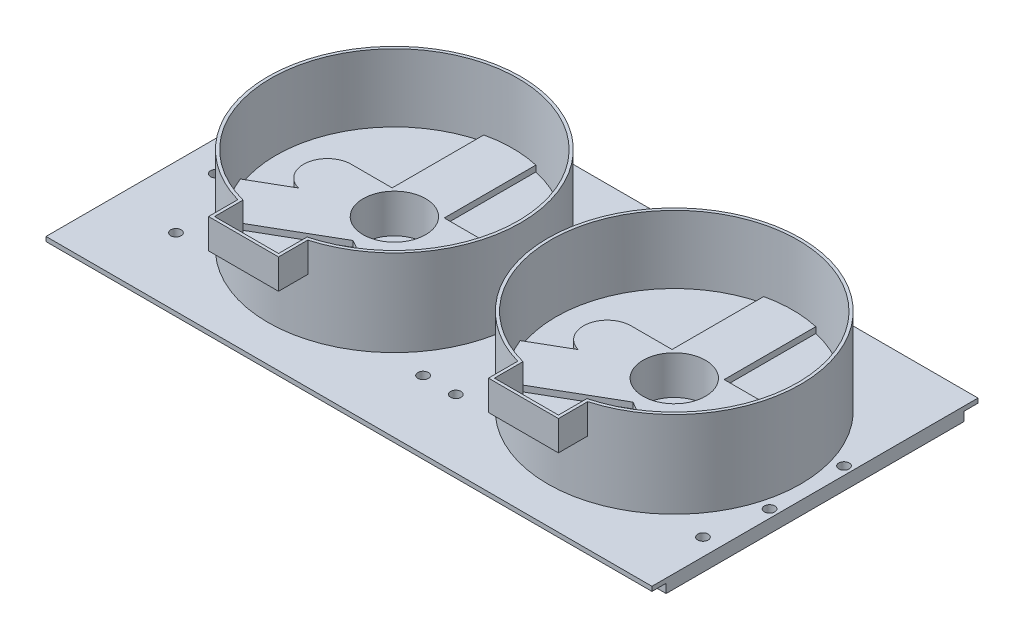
ISO-10303-21;
HEADER;
FILE_DESCRIPTION(('STEP AP214'),'2;1');
FILE_NAME('part.step','',(''),(''),'','','');
FILE_SCHEMA(('AUTOMOTIVE_DESIGN { 1 0 10303 214 1 1 1 1 }'));
ENDSEC;
DATA;
#1=APPLICATION_CONTEXT('core data for automotive mechanical design processes');
#2=APPLICATION_PROTOCOL_DEFINITION('international standard','automotive_design',2000,#1);
#3=PRODUCT_CONTEXT('',#1,'mechanical');
#4=PRODUCT('Part','Part','',(#3));
#5=PRODUCT_RELATED_PRODUCT_CATEGORY('part','',(#4));
#6=PRODUCT_DEFINITION_FORMATION('','',#4);
#7=PRODUCT_DEFINITION_CONTEXT('part definition',#1,'design');
#8=PRODUCT_DEFINITION('design','',#6,#7);
#9=PRODUCT_DEFINITION_SHAPE('','',#8);
#10=(LENGTH_UNIT() NAMED_UNIT(*) SI_UNIT(.MILLI.,.METRE.));
#11=(NAMED_UNIT(*) PLANE_ANGLE_UNIT() SI_UNIT($,.RADIAN.));
#12=(NAMED_UNIT(*) SI_UNIT($,.STERADIAN.) SOLID_ANGLE_UNIT());
#13=UNCERTAINTY_MEASURE_WITH_UNIT(LENGTH_MEASURE(1.E-05),#10,'distance_accuracy_value','');
#14=(GEOMETRIC_REPRESENTATION_CONTEXT(3) GLOBAL_UNCERTAINTY_ASSIGNED_CONTEXT((#13)) GLOBAL_UNIT_ASSIGNED_CONTEXT((#10,
#11,#12)) REPRESENTATION_CONTEXT('',''));
#15=CARTESIAN_POINT('',(0.,0.,0.));
#16=DIRECTION('',(0.,0.,1.));
#17=DIRECTION('',(1.,0.,0.));
#18=AXIS2_PLACEMENT_3D('',#15,#16,#17);
#19=CARTESIAN_POINT('',(47.25,0.,0.));
#20=DIRECTION('',(1.,0.,0.));
#21=DIRECTION('',(0.,0.,-1.));
#22=AXIS2_PLACEMENT_3D('',#19,#20,#21);
#23=PLANE('',#22);
#24=DIRECTION('',(0.,0.,-1.));
#25=VECTOR('',#24,1.);
#26=CARTESIAN_POINT('',(47.25,3.,50.));
#27=LINE('',#26,#25);
#28=CARTESIAN_POINT('',(47.25,3.,54.75));
#29=VERTEX_POINT('',#28);
#30=CARTESIAN_POINT('',(47.25,3.,50.));
#31=VERTEX_POINT('',#30);
#32=EDGE_CURVE('E184',#29,#31,#27,.T.);
#33=ORIENTED_EDGE('',*,*,#32,.T.);
#34=DIRECTION('',(0.,-1.,0.));
#35=VECTOR('',#34,1.);
#36=CARTESIAN_POINT('',(47.25,3.,50.));
#37=LINE('',#36,#35);
#38=CARTESIAN_POINT('',(47.25,0.,50.));
#39=VERTEX_POINT('',#38);
#40=EDGE_CURVE('E175',#31,#39,#37,.T.);
#41=ORIENTED_EDGE('',*,*,#40,.T.);
#42=DIRECTION('',(0.,0.,-1.));
#43=VECTOR('',#42,1.);
#44=CARTESIAN_POINT('',(47.25,0.,0.));
#45=LINE('',#44,#43);
#46=CARTESIAN_POINT('',(47.25,0.,-50.));
#47=VERTEX_POINT('',#46);
#48=EDGE_CURVE('E181',#39,#47,#45,.T.);
#49=ORIENTED_EDGE('',*,*,#48,.T.);
#50=DIRECTION('',(0.,1.,0.));
#51=VECTOR('',#50,1.);
#52=CARTESIAN_POINT('',(47.25,3.,-50.));
#53=LINE('',#52,#51);
#54=CARTESIAN_POINT('',(47.25,3.,-50.));
#55=VERTEX_POINT('',#54);
#56=EDGE_CURVE('E178',#47,#55,#53,.T.);
#57=ORIENTED_EDGE('',*,*,#56,.T.);
#58=CARTESIAN_POINT('',(47.25,3.,-54.75));
#59=VERTEX_POINT('',#58);
#60=EDGE_CURVE('E185',#55,#59,#27,.T.);
#61=ORIENTED_EDGE('',*,*,#60,.T.);
#62=DIRECTION('',(0.,1.,0.));
#63=VECTOR('',#62,1.);
#64=CARTESIAN_POINT('',(47.25,0.,-54.75));
#65=LINE('',#64,#63);
#66=CARTESIAN_POINT('',(47.25,4.5,-54.75));
#67=VERTEX_POINT('',#66);
#68=EDGE_CURVE('E191',#59,#67,#65,.T.);
#69=ORIENTED_EDGE('',*,*,#68,.T.);
#70=DIRECTION('',(0.,0.,-1.));
#71=VECTOR('',#70,1.);
#72=CARTESIAN_POINT('',(47.25,4.5,0.));
#73=LINE('',#72,#71);
#74=CARTESIAN_POINT('',(47.25,4.5,54.75));
#75=VERTEX_POINT('',#74);
#76=EDGE_CURVE('E172',#75,#67,#73,.T.);
#77=ORIENTED_EDGE('',*,*,#76,.F.);
#78=DIRECTION('',(0.,-1.,0.));
#79=VECTOR('',#78,1.);
#80=CARTESIAN_POINT('',(47.25,0.,54.75));
#81=LINE('',#80,#79);
#82=EDGE_CURVE('E188',#75,#29,#81,.T.);
#83=ORIENTED_EDGE('',*,*,#82,.T.);
#84=EDGE_LOOP('',(#33,#41,#49,#57,#61,#69,#77,#83));
#85=FACE_BOUND('',#84,.T.);
#86=ADVANCED_FACE('F42',(#85),#23,.T.);
#87=CARTESIAN_POINT('',(-151.5,3.,50.));
#88=DIRECTION('',(0.,0.,-1.));
#89=DIRECTION('',(-1.,0.,0.));
#90=AXIS2_PLACEMENT_3D('',#87,#88,#89);
#91=PLANE('',#90);
#92=ORIENTED_EDGE('',*,*,#40,.F.);
#93=DIRECTION('',(1.,0.,0.));
#94=VECTOR('',#93,1.);
#95=CARTESIAN_POINT('',(156.25,3.,50.));
#96=LINE('',#95,#94);
#97=CARTESIAN_POINT('',(-151.5,3.,50.));
#98=VERTEX_POINT('',#97);
#99=EDGE_CURVE('E197',#98,#31,#96,.T.);
#100=ORIENTED_EDGE('',*,*,#99,.F.);
#101=DIRECTION('',(0.,-1.,0.));
#102=VECTOR('',#101,1.);
#103=CARTESIAN_POINT('',(-151.5,3.,50.));
#104=LINE('',#103,#102);
#105=CARTESIAN_POINT('',(-151.5,0.,50.));
#106=VERTEX_POINT('',#105);
#107=EDGE_CURVE('E206',#98,#106,#104,.T.);
#108=ORIENTED_EDGE('',*,*,#107,.T.);
#109=DIRECTION('',(1.,0.,0.));
#110=VECTOR('',#109,1.);
#111=CARTESIAN_POINT('',(-151.5,0.,50.));
#112=LINE('',#111,#110);
#113=EDGE_CURVE('E202',#106,#39,#112,.T.);
#114=ORIENTED_EDGE('',*,*,#113,.T.);
#115=EDGE_LOOP('',(#92,#100,#108,#114));
#116=FACE_BOUND('',#115,.T.);
#117=ADVANCED_FACE('F1168',(#116),#91,.F.);
#118=CARTESIAN_POINT('',(-151.5,3.,-50.));
#119=DIRECTION('',(0.,0.,1.));
#120=DIRECTION('',(1.,0.,0.));
#121=AXIS2_PLACEMENT_3D('',#118,#119,#120);
#122=PLANE('',#121);
#123=ORIENTED_EDGE('',*,*,#56,.F.);
#124=DIRECTION('',(-1.,0.,0.));
#125=VECTOR('',#124,1.);
#126=CARTESIAN_POINT('',(-151.5,0.,-50.));
#127=LINE('',#126,#125);
#128=CARTESIAN_POINT('',(-151.5,0.,-50.));
#129=VERTEX_POINT('',#128);
#130=EDGE_CURVE('E207',#47,#129,#127,.T.);
#131=ORIENTED_EDGE('',*,*,#130,.T.);
#132=DIRECTION('',(0.,-1.,0.));
#133=VECTOR('',#132,1.);
#134=CARTESIAN_POINT('',(-151.5,3.,-50.));
#135=LINE('',#134,#133);
#136=CARTESIAN_POINT('',(-151.5,3.,-50.));
#137=VERTEX_POINT('',#136);
#138=EDGE_CURVE('E201',#137,#129,#135,.T.);
#139=ORIENTED_EDGE('',*,*,#138,.F.);
#140=DIRECTION('',(1.,0.,0.));
#141=VECTOR('',#140,1.);
#142=CARTESIAN_POINT('',(156.25,3.,-50.));
#143=LINE('',#142,#141);
#144=EDGE_CURVE('E194',#137,#55,#143,.T.);
#145=ORIENTED_EDGE('',*,*,#144,.T.);
#146=EDGE_LOOP('',(#123,#131,#139,#145));
#147=FACE_BOUND('',#146,.T.);
#148=ADVANCED_FACE('F1164',(#147),#122,.F.);
#149=CARTESIAN_POINT('',(0.,0.,0.));
#150=DIRECTION('',(0.,1.,0.));
#151=DIRECTION('',(0.,0.,1.));
#152=AXIS2_PLACEMENT_3D('',#149,#150,#151);
#153=PLANE('',#152);
#154=DIRECTION('',(-1.,0.,0.));
#155=VECTOR('',#154,1.);
#156=CARTESIAN_POINT('',(-6.49999999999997,0.,26.3604526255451));
#157=LINE('',#156,#155);
#158=CARTESIAN_POINT('',(6.50000000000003,0.,26.3604526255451));
#159=VERTEX_POINT('',#158);
#160=CARTESIAN_POINT('',(-6.49999999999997,0.,26.3604526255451));
#161=VERTEX_POINT('',#160);
#162=EDGE_CURVE('E1043',#159,#161,#157,.T.);
#163=ORIENTED_EDGE('',*,*,#162,.T.);
#164=CARTESIAN_POINT('',(-6.49999999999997,0.,28.3604526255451));
#165=DIRECTION('',(0.,1.,0.));
#166=DIRECTION('',(0.,0.,1.));
#167=AXIS2_PLACEMENT_3D('',#164,#165,#166);
#168=CIRCLE('',#167,2.);
#169=CARTESIAN_POINT('',(-8.49999999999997,0.,28.3604526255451));
#170=VERTEX_POINT('',#169);
#171=EDGE_CURVE('E1077',#161,#170,#168,.T.);
#172=ORIENTED_EDGE('',*,*,#171,.T.);
#173=DIRECTION('',(0.,0.,1.));
#174=VECTOR('',#173,1.);
#175=CARTESIAN_POINT('',(-8.49999999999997,0.,28.3604526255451));
#176=LINE('',#175,#174);
#177=CARTESIAN_POINT('',(-8.49999999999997,0.,35.3604526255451));
#178=VERTEX_POINT('',#177);
#179=EDGE_CURVE('E1074',#170,#178,#176,.T.);
#180=ORIENTED_EDGE('',*,*,#179,.T.);
#181=CARTESIAN_POINT('',(-6.49999999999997,0.,35.3604526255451));
#182=DIRECTION('',(0.,1.,0.));
#183=DIRECTION('',(0.,0.,1.));
#184=AXIS2_PLACEMENT_3D('',#181,#182,#183);
#185=CIRCLE('',#184,2.);
#186=CARTESIAN_POINT('',(-6.49999999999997,0.,37.3604526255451));
#187=VERTEX_POINT('',#186);
#188=EDGE_CURVE('E1071',#178,#187,#185,.T.);
#189=ORIENTED_EDGE('',*,*,#188,.T.);
#190=DIRECTION('',(1.,0.,0.));
#191=VECTOR('',#190,1.);
#192=CARTESIAN_POINT('',(-6.49999999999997,0.,37.3604526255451));
#193=LINE('',#192,#191);
#194=CARTESIAN_POINT('',(6.50000000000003,0.,37.3604526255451));
#195=VERTEX_POINT('',#194);
#196=EDGE_CURVE('E1068',#187,#195,#193,.T.);
#197=ORIENTED_EDGE('',*,*,#196,.T.);
#198=CARTESIAN_POINT('',(6.50000000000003,0.,35.3604526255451));
#199=DIRECTION('',(0.,1.,0.));
#200=DIRECTION('',(0.,0.,1.));
#201=AXIS2_PLACEMENT_3D('',#198,#199,#200);
#202=CIRCLE('',#201,2.);
#203=CARTESIAN_POINT('',(8.50000000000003,0.,35.3604526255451));
#204=VERTEX_POINT('',#203);
#205=EDGE_CURVE('E1065',#195,#204,#202,.T.);
#206=ORIENTED_EDGE('',*,*,#205,.T.);
#207=DIRECTION('',(0.,0.,-1.));
#208=VECTOR('',#207,1.);
#209=CARTESIAN_POINT('',(8.50000000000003,0.,28.3604526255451));
#210=LINE('',#209,#208);
#211=CARTESIAN_POINT('',(8.50000000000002,0.,28.3604526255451));
#212=VERTEX_POINT('',#211);
#213=EDGE_CURVE('E1062',#204,#212,#210,.T.);
#214=ORIENTED_EDGE('',*,*,#213,.T.);
#215=CARTESIAN_POINT('',(6.50000000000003,0.,28.3604526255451));
#216=DIRECTION('',(0.,1.,0.));
#217=DIRECTION('',(0.,0.,-1.));
#218=AXIS2_PLACEMENT_3D('',#215,#216,#217);
#219=CIRCLE('',#218,2.);
#220=EDGE_CURVE('E1059',#212,#159,#219,.T.);
#221=ORIENTED_EDGE('',*,*,#220,.T.);
#222=EDGE_LOOP('',(#163,#172,#180,#189,#197,#206,#214,#221));
#223=FACE_BOUND('',#222,.T.);
#224=DIRECTION('',(1.,0.,0.));
#225=VECTOR('',#224,1.);
#226=CARTESIAN_POINT('',(-100.5,0.,37.3604526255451));
#227=LINE('',#226,#225);
#228=CARTESIAN_POINT('',(-100.5,0.,37.3604526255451));
#229=VERTEX_POINT('',#228);
#230=CARTESIAN_POINT('',(-87.5,0.,37.3604526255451));
#231=VERTEX_POINT('',#230);
#232=EDGE_CURVE('E1101',#229,#231,#227,.T.);
#233=ORIENTED_EDGE('',*,*,#232,.T.);
#234=CARTESIAN_POINT('',(-87.5,0.,35.3604526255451));
#235=DIRECTION('',(0.,1.,0.));
#236=DIRECTION('',(0.,0.,1.));
#237=AXIS2_PLACEMENT_3D('',#234,#235,#236);
#238=CIRCLE('',#237,1.99999999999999);
#239=CARTESIAN_POINT('',(-85.5,0.,35.3604526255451));
#240=VERTEX_POINT('',#239);
#241=EDGE_CURVE('E1080',#231,#240,#238,.T.);
#242=ORIENTED_EDGE('',*,*,#241,.T.);
#243=DIRECTION('',(0.,0.,-1.));
#244=VECTOR('',#243,1.);
#245=CARTESIAN_POINT('',(-85.5,0.,28.3604526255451));
#246=LINE('',#245,#244);
#247=CARTESIAN_POINT('',(-85.5,0.,28.3604526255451));
#248=VERTEX_POINT('',#247);
#249=EDGE_CURVE('E1083',#240,#248,#246,.T.);
#250=ORIENTED_EDGE('',*,*,#249,.T.);
#251=CARTESIAN_POINT('',(-87.5,0.,28.3604526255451));
#252=DIRECTION('',(0.,1.,0.));
#253=DIRECTION('',(0.,0.,-1.));
#254=AXIS2_PLACEMENT_3D('',#251,#252,#253);
#255=CIRCLE('',#254,2.00000000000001);
#256=CARTESIAN_POINT('',(-87.5,0.,26.3604526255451));
#257=VERTEX_POINT('',#256);
#258=EDGE_CURVE('E1086',#248,#257,#255,.T.);
#259=ORIENTED_EDGE('',*,*,#258,.T.);
#260=DIRECTION('',(-1.,0.,0.));
#261=VECTOR('',#260,1.);
#262=CARTESIAN_POINT('',(-100.5,0.,26.3604526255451));
#263=LINE('',#262,#261);
#264=CARTESIAN_POINT('',(-100.5,0.,26.3604526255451));
#265=VERTEX_POINT('',#264);
#266=EDGE_CURVE('E1089',#257,#265,#263,.T.);
#267=ORIENTED_EDGE('',*,*,#266,.T.);
#268=CARTESIAN_POINT('',(-100.5,0.,28.3604526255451));
#269=DIRECTION('',(0.,1.,0.));
#270=DIRECTION('',(0.,0.,1.));
#271=AXIS2_PLACEMENT_3D('',#268,#269,#270);
#272=CIRCLE('',#271,2.);
#273=CARTESIAN_POINT('',(-102.5,0.,28.3604526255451));
#274=VERTEX_POINT('',#273);
#275=EDGE_CURVE('E1092',#265,#274,#272,.T.);
#276=ORIENTED_EDGE('',*,*,#275,.T.);
#277=DIRECTION('',(0.,0.,1.));
#278=VECTOR('',#277,1.);
#279=CARTESIAN_POINT('',(-102.5,0.,28.3604526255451));
#280=LINE('',#279,#278);
#281=CARTESIAN_POINT('',(-102.5,0.,35.3604526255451));
#282=VERTEX_POINT('',#281);
#283=EDGE_CURVE('E1095',#274,#282,#280,.T.);
#284=ORIENTED_EDGE('',*,*,#283,.T.);
#285=CARTESIAN_POINT('',(-100.5,0.,35.3604526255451));
#286=DIRECTION('',(0.,1.,0.));
#287=DIRECTION('',(0.,0.,1.));
#288=AXIS2_PLACEMENT_3D('',#285,#286,#287);
#289=CIRCLE('',#288,2.);
#290=EDGE_CURVE('E1098',#282,#229,#289,.T.);
#291=ORIENTED_EDGE('',*,*,#290,.T.);
#292=EDGE_LOOP('',(#233,#242,#250,#259,#267,#276,#284,#291));
#293=FACE_BOUND('',#292,.T.);
#294=CARTESIAN_POINT('',(0.,0.,0.));
#295=DIRECTION('',(0.,1.,0.));
#296=DIRECTION('',(0.,0.,1.));
#297=AXIS2_PLACEMENT_3D('',#294,#295,#296);
#298=CIRCLE('',#297,6.);
#299=CARTESIAN_POINT('',(0.,0.,6.));
#300=VERTEX_POINT('',#299);
#301=EDGE_CURVE('E279',#300,#300,#298,.T.);
#302=ORIENTED_EDGE('',*,*,#301,.T.);
#303=EDGE_LOOP('',(#302));
#304=FACE_BOUND('',#303,.T.);
#305=CARTESIAN_POINT('',(-93.9999999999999,0.,0.));
#306=DIRECTION('',(0.,1.,0.));
#307=DIRECTION('',(0.,0.,1.));
#308=AXIS2_PLACEMENT_3D('',#305,#306,#307);
#309=CIRCLE('',#308,6.);
#310=CARTESIAN_POINT('',(-93.9999999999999,0.,6.));
#311=VERTEX_POINT('',#310);
#312=EDGE_CURVE('E282',#311,#311,#309,.T.);
#313=ORIENTED_EDGE('',*,*,#312,.T.);
#314=EDGE_LOOP('',(#313));
#315=FACE_BOUND('',#314,.T.);
#316=CARTESIAN_POINT('',(41.5,0.,31.8604526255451));
#317=DIRECTION('',(0.,-1.,0.));
#318=DIRECTION('',(0.,0.,-1.));
#319=AXIS2_PLACEMENT_3D('',#316,#317,#318);
#320=CIRCLE('',#319,1.74999999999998);
#321=CARTESIAN_POINT('',(41.5,0.,30.1104526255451));
#322=VERTEX_POINT('',#321);
#323=EDGE_CURVE('E514',#322,#322,#320,.T.);
#324=ORIENTED_EDGE('',*,*,#323,.F.);
#325=EDGE_LOOP('',(#324));
#326=FACE_BOUND('',#325,.T.);
#327=CARTESIAN_POINT('',(44.5,0.,12.5));
#328=DIRECTION('',(0.,-1.,0.));
#329=DIRECTION('',(0.,0.,-1.));
#330=AXIS2_PLACEMENT_3D('',#327,#328,#329);
#331=CIRCLE('',#330,1.75);
#332=CARTESIAN_POINT('',(44.5,0.,10.75));
#333=VERTEX_POINT('',#332);
#334=EDGE_CURVE('E534',#333,#333,#331,.T.);
#335=ORIENTED_EDGE('',*,*,#334,.F.);
#336=EDGE_LOOP('',(#335));
#337=FACE_BOUND('',#336,.T.);
#338=CARTESIAN_POINT('',(44.5,0.,-12.5));
#339=DIRECTION('',(0.,-1.,0.));
#340=DIRECTION('',(0.,0.,-1.));
#341=AXIS2_PLACEMENT_3D('',#338,#339,#340);
#342=CIRCLE('',#341,1.75);
#343=CARTESIAN_POINT('',(44.5,0.,-14.25));
#344=VERTEX_POINT('',#343);
#345=EDGE_CURVE('E533',#344,#344,#342,.T.);
#346=ORIENTED_EDGE('',*,*,#345,.F.);
#347=EDGE_LOOP('',(#346));
#348=FACE_BOUND('',#347,.T.);
#349=CARTESIAN_POINT('',(-135.5,0.,31.8604526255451));
#350=DIRECTION('',(0.,-1.,0.));
#351=DIRECTION('',(0.,0.,-1.));
#352=AXIS2_PLACEMENT_3D('',#349,#350,#351);
#353=CIRCLE('',#352,1.75000000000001);
#354=CARTESIAN_POINT('',(-135.5,0.,30.1104526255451));
#355=VERTEX_POINT('',#354);
#356=EDGE_CURVE('E521',#355,#355,#353,.T.);
#357=ORIENTED_EDGE('',*,*,#356,.F.);
#358=EDGE_LOOP('',(#357));
#359=FACE_BOUND('',#358,.T.);
#360=CARTESIAN_POINT('',(-41.5,0.,31.8604526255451));
#361=DIRECTION('',(0.,-1.,0.));
#362=DIRECTION('',(0.,0.,-1.));
#363=AXIS2_PLACEMENT_3D('',#360,#361,#362);
#364=CIRCLE('',#363,1.75);
#365=CARTESIAN_POINT('',(-41.5,0.,30.1104526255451));
#366=VERTEX_POINT('',#365);
#367=EDGE_CURVE('E517',#366,#366,#364,.T.);
#368=ORIENTED_EDGE('',*,*,#367,.F.);
#369=EDGE_LOOP('',(#368));
#370=FACE_BOUND('',#369,.T.);
#371=CARTESIAN_POINT('',(-146.,0.,8.));
#372=DIRECTION('',(0.,-1.,0.));
#373=DIRECTION('',(0.,0.,1.));
#374=AXIS2_PLACEMENT_3D('',#371,#372,#373);
#375=CIRCLE('',#374,1.75000000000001);
#376=CARTESIAN_POINT('',(-146.,0.,9.75000000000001));
#377=VERTEX_POINT('',#376);
#378=EDGE_CURVE('E528',#377,#377,#375,.T.);
#379=ORIENTED_EDGE('',*,*,#378,.F.);
#380=EDGE_LOOP('',(#379));
#381=FACE_BOUND('',#380,.T.);
#382=CARTESIAN_POINT('',(-146.,0.,-8.));
#383=DIRECTION('',(0.,-1.,0.));
#384=DIRECTION('',(0.,0.,-1.));
#385=AXIS2_PLACEMENT_3D('',#382,#383,#384);
#386=CIRCLE('',#385,1.75000000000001);
#387=CARTESIAN_POINT('',(-146.,0.,-9.75000000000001));
#388=VERTEX_POINT('',#387);
#389=EDGE_CURVE('E525',#388,#388,#386,.T.);
#390=ORIENTED_EDGE('',*,*,#389,.F.);
#391=EDGE_LOOP('',(#390));
#392=FACE_BOUND('',#391,.T.);
#393=CARTESIAN_POINT('',(-52.5,0.,31.8604526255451));
#394=DIRECTION('',(0.,-1.,0.));
#395=DIRECTION('',(0.,0.,-1.));
#396=AXIS2_PLACEMENT_3D('',#393,#394,#395);
#397=CIRCLE('',#396,1.75);
#398=CARTESIAN_POINT('',(-52.5,0.,30.1104526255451));
#399=VERTEX_POINT('',#398);
#400=EDGE_CURVE('E524',#399,#399,#397,.T.);
#401=ORIENTED_EDGE('',*,*,#400,.F.);
#402=EDGE_LOOP('',(#401));
#403=FACE_BOUND('',#402,.T.);
#404=ORIENTED_EDGE('',*,*,#48,.F.);
#405=ORIENTED_EDGE('',*,*,#113,.F.);
#406=DIRECTION('',(0.,0.,1.));
#407=VECTOR('',#406,1.);
#408=CARTESIAN_POINT('',(-151.5,0.,-50.));
#409=LINE('',#408,#407);
#410=EDGE_CURVE('E205',#129,#106,#409,.T.);
#411=ORIENTED_EDGE('',*,*,#410,.F.);
#412=ORIENTED_EDGE('',*,*,#130,.F.);
#413=EDGE_LOOP('',(#404,#405,#411,#412));
#414=FACE_BOUND('',#413,.T.);
#415=ADVANCED_FACE('F44',(#223,#293,#304,#315,#326,#337,#348,#359,#370,#381,#392,#403,#414),
#153,.F.);
#416=CARTESIAN_POINT('',(0.,4.5,0.));
#417=DIRECTION('',(0.,1.,0.));
#418=DIRECTION('',(0.,0.,1.));
#419=AXIS2_PLACEMENT_3D('',#416,#417,#418);
#420=PLANE('',#419);
#421=CARTESIAN_POINT('',(0.,4.5,0.));
#422=DIRECTION('',(0.,1.,0.));
#423=DIRECTION('',(0.,0.,1.));
#424=AXIS2_PLACEMENT_3D('',#421,#422,#423);
#425=CIRCLE('',#424,42.5);
#426=CARTESIAN_POINT('',(0.,4.5,42.5));
#427=VERTEX_POINT('',#426);
#428=EDGE_CURVE('E495',#427,#427,#425,.T.);
#429=ORIENTED_EDGE('',*,*,#428,.F.);
#430=EDGE_LOOP('',(#429));
#431=FACE_BOUND('',#430,.T.);
#432=CARTESIAN_POINT('',(-93.9999999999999,4.5,0.));
#433=DIRECTION('',(0.,1.,0.));
#434=DIRECTION('',(0.,0.,1.));
#435=AXIS2_PLACEMENT_3D('',#432,#433,#434);
#436=CIRCLE('',#435,42.5);
#437=CARTESIAN_POINT('',(-93.9999999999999,4.5,42.5));
#438=VERTEX_POINT('',#437);
#439=EDGE_CURVE('E503',#438,#438,#436,.T.);
#440=ORIENTED_EDGE('',*,*,#439,.F.);
#441=EDGE_LOOP('',(#440));
#442=FACE_BOUND('',#441,.T.);
#443=CARTESIAN_POINT('',(41.5,4.5,31.8604526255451));
#444=DIRECTION('',(0.,1.,0.));
#445=DIRECTION('',(0.,0.,1.));
#446=AXIS2_PLACEMENT_3D('',#443,#444,#445);
#447=CIRCLE('',#446,1.74999999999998);
#448=CARTESIAN_POINT('',(41.5,4.5,33.6104526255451));
#449=VERTEX_POINT('',#448);
#450=EDGE_CURVE('E518',#449,#449,#447,.T.);
#451=ORIENTED_EDGE('',*,*,#450,.F.);
#452=EDGE_LOOP('',(#451));
#453=FACE_BOUND('',#452,.T.);
#454=CARTESIAN_POINT('',(44.5,4.5,12.5));
#455=DIRECTION('',(0.,1.,0.));
#456=DIRECTION('',(0.,0.,1.));
#457=AXIS2_PLACEMENT_3D('',#454,#455,#456);
#458=CIRCLE('',#457,1.75);
#459=CARTESIAN_POINT('',(44.5,4.5,14.25));
#460=VERTEX_POINT('',#459);
#461=EDGE_CURVE('E2692',#460,#460,#458,.T.);
#462=ORIENTED_EDGE('',*,*,#461,.F.);
#463=EDGE_LOOP('',(#462));
#464=FACE_BOUND('',#463,.T.);
#465=CARTESIAN_POINT('',(44.5,4.5,-12.5));
#466=DIRECTION('',(0.,1.,0.));
#467=DIRECTION('',(0.,0.,1.));
#468=AXIS2_PLACEMENT_3D('',#465,#466,#467);
#469=CIRCLE('',#468,1.75);
#470=CARTESIAN_POINT('',(44.5,4.5,-10.75));
#471=VERTEX_POINT('',#470);
#472=EDGE_CURVE('E2690',#471,#471,#469,.T.);
#473=ORIENTED_EDGE('',*,*,#472,.F.);
#474=EDGE_LOOP('',(#473));
#475=FACE_BOUND('',#474,.T.);
#476=CARTESIAN_POINT('',(-135.5,4.5,31.8604526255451));
#477=DIRECTION('',(0.,1.,0.));
#478=DIRECTION('',(0.,0.,1.));
#479=AXIS2_PLACEMENT_3D('',#476,#477,#478);
#480=CIRCLE('',#479,1.75000000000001);
#481=CARTESIAN_POINT('',(-135.5,4.5,33.6104526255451));
#482=VERTEX_POINT('',#481);
#483=EDGE_CURVE('E2693',#482,#482,#480,.T.);
#484=ORIENTED_EDGE('',*,*,#483,.F.);
#485=EDGE_LOOP('',(#484));
#486=FACE_BOUND('',#485,.T.);
#487=CARTESIAN_POINT('',(-41.5,4.5,31.8604526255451));
#488=DIRECTION('',(0.,1.,0.));
#489=DIRECTION('',(0.,0.,1.));
#490=AXIS2_PLACEMENT_3D('',#487,#488,#489);
#491=CIRCLE('',#490,1.75);
#492=CARTESIAN_POINT('',(-41.5,4.5,33.6104526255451));
#493=VERTEX_POINT('',#492);
#494=EDGE_CURVE('E2697',#493,#493,#491,.T.);
#495=ORIENTED_EDGE('',*,*,#494,.F.);
#496=EDGE_LOOP('',(#495));
#497=FACE_BOUND('',#496,.T.);
#498=CARTESIAN_POINT('',(-146.,4.5,8.));
#499=DIRECTION('',(0.,1.,0.));
#500=DIRECTION('',(0.,0.,1.));
#501=AXIS2_PLACEMENT_3D('',#498,#499,#500);
#502=CIRCLE('',#501,1.75000000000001);
#503=CARTESIAN_POINT('',(-146.,4.5,9.75000000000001));
#504=VERTEX_POINT('',#503);
#505=EDGE_CURVE('E2702',#504,#504,#502,.T.);
#506=ORIENTED_EDGE('',*,*,#505,.F.);
#507=EDGE_LOOP('',(#506));
#508=FACE_BOUND('',#507,.T.);
#509=CARTESIAN_POINT('',(-146.,4.5,-8.));
#510=DIRECTION('',(0.,1.,0.));
#511=DIRECTION('',(0.,0.,1.));
#512=AXIS2_PLACEMENT_3D('',#509,#510,#511);
#513=CIRCLE('',#512,1.75000000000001);
#514=CARTESIAN_POINT('',(-146.,4.5,-6.24999999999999));
#515=VERTEX_POINT('',#514);
#516=EDGE_CURVE('E2705',#515,#515,#513,.T.);
#517=ORIENTED_EDGE('',*,*,#516,.F.);
#518=EDGE_LOOP('',(#517));
#519=FACE_BOUND('',#518,.T.);
#520=CARTESIAN_POINT('',(-52.5,4.5,31.8604526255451));
#521=DIRECTION('',(0.,1.,0.));
#522=DIRECTION('',(0.,0.,1.));
#523=AXIS2_PLACEMENT_3D('',#520,#521,#522);
#524=CIRCLE('',#523,1.75);
#525=CARTESIAN_POINT('',(-52.5,4.5,33.6104526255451));
#526=VERTEX_POINT('',#525);
#527=EDGE_CURVE('E513',#526,#526,#524,.T.);
#528=ORIENTED_EDGE('',*,*,#527,.F.);
#529=EDGE_LOOP('',(#528));
#530=FACE_BOUND('',#529,.T.);
#531=DIRECTION('',(-1.,0.,0.));
#532=VECTOR('',#531,1.);
#533=CARTESIAN_POINT('',(156.25,4.5,54.75));
#534=LINE('',#533,#532);
#535=CARTESIAN_POINT('',(-156.25,4.5,54.75));
#536=VERTEX_POINT('',#535);
#537=EDGE_CURVE('E216',#75,#536,#534,.T.);
#538=ORIENTED_EDGE('',*,*,#537,.F.);
#539=ORIENTED_EDGE('',*,*,#76,.T.);
#540=DIRECTION('',(-1.,0.,0.));
#541=VECTOR('',#540,1.);
#542=CARTESIAN_POINT('',(156.25,4.5,-54.75));
#543=LINE('',#542,#541);
#544=CARTESIAN_POINT('',(-156.25,4.5,-54.75));
#545=VERTEX_POINT('',#544);
#546=EDGE_CURVE('E218',#67,#545,#543,.T.);
#547=ORIENTED_EDGE('',*,*,#546,.T.);
#548=DIRECTION('',(0.,0.,1.));
#549=VECTOR('',#548,1.);
#550=CARTESIAN_POINT('',(-156.25,4.5,50.));
#551=LINE('',#550,#549);
#552=EDGE_CURVE('E1122',#545,#536,#551,.T.);
#553=ORIENTED_EDGE('',*,*,#552,.T.);
#554=EDGE_LOOP('',(#538,#539,#547,#553));
#555=FACE_BOUND('',#554,.T.);
#556=ADVANCED_FACE('F1125',(#431,#442,#453,#464,#475,#486,#497,#508,#519,#530,#555),#420,.T.);
#557=CARTESIAN_POINT('',(156.25,3.,50.));
#558=DIRECTION('',(0.,1.,0.));
#559=DIRECTION('',(0.,0.,1.));
#560=AXIS2_PLACEMENT_3D('',#557,#558,#559);
#561=PLANE('',#560);
#562=ORIENTED_EDGE('',*,*,#32,.F.);
#563=DIRECTION('',(1.,0.,0.));
#564=VECTOR('',#563,1.);
#565=CARTESIAN_POINT('',(156.25,3.,54.75));
#566=LINE('',#565,#564);
#567=CARTESIAN_POINT('',(-156.25,3.,54.75));
#568=VERTEX_POINT('',#567);
#569=EDGE_CURVE('E211',#568,#29,#566,.T.);
#570=ORIENTED_EDGE('',*,*,#569,.F.);
#571=DIRECTION('',(0.,0.,-1.));
#572=VECTOR('',#571,1.);
#573=CARTESIAN_POINT('',(-156.25,3.,50.));
#574=LINE('',#573,#572);
#575=CARTESIAN_POINT('',(-156.25,3.,-54.75));
#576=VERTEX_POINT('',#575);
#577=EDGE_CURVE('E1107',#568,#576,#574,.T.);
#578=ORIENTED_EDGE('',*,*,#577,.T.);
#579=DIRECTION('',(1.,0.,0.));
#580=VECTOR('',#579,1.);
#581=CARTESIAN_POINT('',(156.25,3.,-54.75));
#582=LINE('',#581,#580);
#583=EDGE_CURVE('E46',#576,#59,#582,.T.);
#584=ORIENTED_EDGE('',*,*,#583,.T.);
#585=ORIENTED_EDGE('',*,*,#60,.F.);
#586=ORIENTED_EDGE('',*,*,#144,.F.);
#587=DIRECTION('',(0.,0.,-1.));
#588=VECTOR('',#587,1.);
#589=CARTESIAN_POINT('',(-151.5,3.,50.));
#590=LINE('',#589,#588);
#591=EDGE_CURVE('E215',#98,#137,#590,.T.);
#592=ORIENTED_EDGE('',*,*,#591,.F.);
#593=ORIENTED_EDGE('',*,*,#99,.T.);
#594=EDGE_LOOP('',(#562,#570,#578,#584,#585,#586,#592,#593));
#595=FACE_BOUND('',#594,.T.);
#596=ADVANCED_FACE('F1137',(#595),#561,.F.);
#597=CARTESIAN_POINT('',(0.,0.,54.75));
#598=DIRECTION('',(0.,0.,-1.));
#599=DIRECTION('',(-1.,0.,0.));
#600=AXIS2_PLACEMENT_3D('',#597,#598,#599);
#601=PLANE('',#600);
#602=ORIENTED_EDGE('',*,*,#82,.F.);
#603=ORIENTED_EDGE('',*,*,#537,.T.);
#604=DIRECTION('',(0.,-1.,0.));
#605=VECTOR('',#604,1.);
#606=CARTESIAN_POINT('',(-156.25,4.5,54.75));
#607=LINE('',#606,#605);
#608=EDGE_CURVE('E214',#536,#568,#607,.T.);
#609=ORIENTED_EDGE('',*,*,#608,.T.);
#610=ORIENTED_EDGE('',*,*,#569,.T.);
#611=EDGE_LOOP('',(#602,#603,#609,#610));
#612=FACE_BOUND('',#611,.T.);
#613=ADVANCED_FACE('F1133',(#612),#601,.F.);
#614=CARTESIAN_POINT('',(0.,0.,-54.75));
#615=DIRECTION('',(0.,0.,1.));
#616=DIRECTION('',(-1.,0.,0.));
#617=AXIS2_PLACEMENT_3D('',#614,#615,#616);
#618=PLANE('',#617);
#619=ORIENTED_EDGE('',*,*,#68,.F.);
#620=ORIENTED_EDGE('',*,*,#583,.F.);
#621=DIRECTION('',(0.,-1.,0.));
#622=VECTOR('',#621,1.);
#623=CARTESIAN_POINT('',(-156.25,4.5,-54.75));
#624=LINE('',#623,#622);
#625=EDGE_CURVE('E220',#545,#576,#624,.T.);
#626=ORIENTED_EDGE('',*,*,#625,.F.);
#627=ORIENTED_EDGE('',*,*,#546,.F.);
#628=EDGE_LOOP('',(#619,#620,#626,#627));
#629=FACE_BOUND('',#628,.T.);
#630=ADVANCED_FACE('F1174',(#629),#618,.F.);
#631=CARTESIAN_POINT('',(0.,23.5,0.));
#632=DIRECTION('',(0.,1.,0.));
#633=DIRECTION('',(0.,0.,1.));
#634=AXIS2_PLACEMENT_3D('',#631,#632,#633);
#635=PLANE('',#634);
#636=CARTESIAN_POINT('',(0.,23.5,0.));
#637=DIRECTION('',(0.,1.,0.));
#638=DIRECTION('',(0.,0.,1.));
#639=AXIS2_PLACEMENT_3D('',#636,#637,#638);
#640=CIRCLE('',#639,42.5);
#641=CARTESIAN_POINT('',(-10.75,23.5,41.1179705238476));
#642=VERTEX_POINT('',#641);
#643=CARTESIAN_POINT('',(10.7500000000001,23.5,41.1179705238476));
#644=VERTEX_POINT('',#643);
#645=EDGE_CURVE('E498',#642,#644,#640,.T.);
#646=ORIENTED_EDGE('',*,*,#645,.T.);
#647=DIRECTION('',(0.,0.,-1.));
#648=VECTOR('',#647,1.);
#649=CARTESIAN_POINT('',(10.7500000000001,23.5,0.));
#650=LINE('',#649,#648);
#651=CARTESIAN_POINT('',(10.7500000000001,23.5,40.0835065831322));
#652=VERTEX_POINT('',#651);
#653=EDGE_CURVE('E137',#644,#652,#650,.T.);
#654=ORIENTED_EDGE('',*,*,#653,.T.);
#655=CARTESIAN_POINT('',(0.,23.5,0.));
#656=DIRECTION('',(0.,1.,0.));
#657=DIRECTION('',(1.,0.,0.));
#658=AXIS2_PLACEMENT_3D('',#655,#656,#657);
#659=CIRCLE('',#658,41.5);
#660=CARTESIAN_POINT('',(-10.7499999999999,23.5,40.0835065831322));
#661=VERTEX_POINT('',#660);
#662=EDGE_CURVE('E107',#661,#652,#659,.T.);
#663=ORIENTED_EDGE('',*,*,#662,.F.);
#664=DIRECTION('',(0.,0.,-1.));
#665=VECTOR('',#664,1.);
#666=CARTESIAN_POINT('',(-10.7499999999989,23.5,-2.81053445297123E-12));
#667=LINE('',#666,#665);
#668=EDGE_CURVE('E150',#642,#661,#667,.T.);
#669=ORIENTED_EDGE('',*,*,#668,.F.);
#670=EDGE_LOOP('',(#646,#654,#663,#669));
#671=FACE_BOUND('',#670,.T.);
#672=ADVANCED_FACE('F631',(#671),#635,.T.);
#673=CARTESIAN_POINT('',(-93.9999999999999,23.5,0.));
#674=DIRECTION('',(0.,1.,0.));
#675=DIRECTION('',(0.,0.,1.));
#676=AXIS2_PLACEMENT_3D('',#673,#674,#675);
#677=PLANE('',#676);
#678=CARTESIAN_POINT('',(-93.9999999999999,23.5,0.));
#679=DIRECTION('',(0.,1.,0.));
#680=DIRECTION('',(0.,0.,1.));
#681=AXIS2_PLACEMENT_3D('',#678,#679,#680);
#682=CIRCLE('',#681,42.5);
#683=CARTESIAN_POINT('',(-104.75,23.5,41.1179705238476));
#684=VERTEX_POINT('',#683);
#685=CARTESIAN_POINT('',(-83.2499999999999,23.5,41.1179705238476));
#686=VERTEX_POINT('',#685);
#687=EDGE_CURVE('E507',#684,#686,#682,.T.);
#688=ORIENTED_EDGE('',*,*,#687,.T.);
#689=DIRECTION('',(0.,0.,-1.));
#690=VECTOR('',#689,1.);
#691=CARTESIAN_POINT('',(-83.2499999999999,23.5,0.));
#692=LINE('',#691,#690);
#693=CARTESIAN_POINT('',(-83.2499999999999,23.5,40.0835065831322));
#694=VERTEX_POINT('',#693);
#695=EDGE_CURVE('E576',#686,#694,#692,.T.);
#696=ORIENTED_EDGE('',*,*,#695,.T.);
#697=CARTESIAN_POINT('',(-93.9999999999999,23.5,0.));
#698=DIRECTION('',(0.,1.,0.));
#699=DIRECTION('',(1.,0.,0.));
#700=AXIS2_PLACEMENT_3D('',#697,#698,#699);
#701=CIRCLE('',#700,41.5);
#702=CARTESIAN_POINT('',(-104.75,23.5,40.0835065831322));
#703=VERTEX_POINT('',#702);
#704=EDGE_CURVE('E506',#703,#694,#701,.T.);
#705=ORIENTED_EDGE('',*,*,#704,.F.);
#706=DIRECTION('',(0.,0.,-1.));
#707=VECTOR('',#706,1.);
#708=CARTESIAN_POINT('',(-104.749999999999,23.5,-2.81053445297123E-12));
#709=LINE('',#708,#707);
#710=EDGE_CURVE('E569',#684,#703,#709,.T.);
#711=ORIENTED_EDGE('',*,*,#710,.F.);
#712=EDGE_LOOP('',(#688,#696,#705,#711));
#713=FACE_BOUND('',#712,.T.);
#714=ADVANCED_FACE('F978',(#713),#677,.T.);
#715=CARTESIAN_POINT('',(-93.9999999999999,4.5,0.));
#716=DIRECTION('',(0.,1.,0.));
#717=DIRECTION('',(0.,0.,1.));
#718=AXIS2_PLACEMENT_3D('',#715,#716,#717);
#719=CIRCLE('',#718,39.75);
#720=CARTESIAN_POINT('',(-93.9999999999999,4.5,39.75));
#721=VERTEX_POINT('',#720);
#722=EDGE_CURVE('E492',#721,#721,#719,.F.);
#723=ORIENTED_EDGE('',*,*,#722,.T.);
#724=EDGE_LOOP('',(#723));
#725=FACE_BOUND('',#724,.T.);
#726=CARTESIAN_POINT('',(-93.9999999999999,4.5,0.));
#727=DIRECTION('',(0.,1.,0.));
#728=DIRECTION('',(0.,0.,1.));
#729=AXIS2_PLACEMENT_3D('',#726,#727,#728);
#730=CIRCLE('',#729,41.5);
#731=CARTESIAN_POINT('',(-93.9999999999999,4.5,41.5));
#732=VERTEX_POINT('',#731);
#733=EDGE_CURVE('E989',#732,#732,#730,.F.);
#734=ORIENTED_EDGE('',*,*,#733,.F.);
#735=EDGE_LOOP('',(#734));
#736=FACE_BOUND('',#735,.T.);
#737=ADVANCED_FACE('F1199',(#725,#736),#420,.T.);
#738=CARTESIAN_POINT('',(0.,4.5,0.));
#739=DIRECTION('',(0.,1.,0.));
#740=DIRECTION('',(0.,0.,1.));
#741=AXIS2_PLACEMENT_3D('',#738,#739,#740);
#742=CIRCLE('',#741,39.75);
#743=CARTESIAN_POINT('',(0.,4.5,39.75));
#744=VERTEX_POINT('',#743);
#745=EDGE_CURVE('E478',#744,#744,#742,.F.);
#746=ORIENTED_EDGE('',*,*,#745,.T.);
#747=EDGE_LOOP('',(#746));
#748=FACE_BOUND('',#747,.T.);
#749=CARTESIAN_POINT('',(0.,4.5,0.));
#750=DIRECTION('',(0.,1.,0.));
#751=DIRECTION('',(0.,0.,1.));
#752=AXIS2_PLACEMENT_3D('',#749,#750,#751);
#753=CIRCLE('',#752,41.5);
#754=CARTESIAN_POINT('',(0.,4.5,41.5));
#755=VERTEX_POINT('',#754);
#756=EDGE_CURVE('E198',#755,#755,#753,.F.);
#757=ORIENTED_EDGE('',*,*,#756,.F.);
#758=EDGE_LOOP('',(#757));
#759=FACE_BOUND('',#758,.T.);
#760=ADVANCED_FACE('F1198',(#748,#759),#420,.T.);
#761=CARTESIAN_POINT('',(0.,14.,0.));
#762=DIRECTION('',(0.,1.,0.));
#763=DIRECTION('',(0.,0.,1.));
#764=AXIS2_PLACEMENT_3D('',#761,#762,#763);
#765=PLANE('',#764);
#766=CARTESIAN_POINT('',(0.,14.,0.));
#767=DIRECTION('',(0.,1.,0.));
#768=DIRECTION('',(0.,0.,1.));
#769=AXIS2_PLACEMENT_3D('',#766,#767,#768);
#770=CIRCLE('',#769,10.5);
#771=CARTESIAN_POINT('',(0.,14.,10.5));
#772=VERTEX_POINT('',#771);
#773=EDGE_CURVE('E286',#772,#772,#770,.T.);
#774=ORIENTED_EDGE('',*,*,#773,.F.);
#775=EDGE_LOOP('',(#774));
#776=FACE_BOUND('',#775,.T.);
#777=DIRECTION('',(-0.86602540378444,0.,-0.499999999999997));
#778=VECTOR('',#777,1.);
#779=CARTESIAN_POINT('',(26.8156791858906,14.,29.3424922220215));
#780=LINE('',#779,#778);
#781=CARTESIAN_POINT('',(26.8156791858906,14.,29.3424922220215));
#782=VERTEX_POINT('',#781);
#783=CARTESIAN_POINT('',(0.,14.,13.8604526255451));
#784=VERTEX_POINT('',#783);
#785=EDGE_CURVE('E307',#782,#784,#780,.T.);
#786=ORIENTED_EDGE('',*,*,#785,.F.);
#787=CARTESIAN_POINT('',(0.,14.,0.));
#788=DIRECTION('',(0.,1.,0.));
#789=DIRECTION('',(0.,0.,-1.));
#790=AXIS2_PLACEMENT_3D('',#787,#788,#789);
#791=CIRCLE('',#790,39.75);
#792=CARTESIAN_POINT('',(36.8420637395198,14.,14.9239686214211));
#793=VERTEX_POINT('',#792);
#794=EDGE_CURVE('E483',#782,#793,#791,.T.);
#795=ORIENTED_EDGE('',*,*,#794,.T.);
#796=DIRECTION('',(0.866025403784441,0.,0.499999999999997));
#797=VECTOR('',#796,1.);
#798=CARTESIAN_POINT('',(36.8420637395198,14.,14.9239686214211));
#799=LINE('',#798,#797);
#800=CARTESIAN_POINT('',(24.4370710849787,14.,7.76194277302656));
#801=VERTEX_POINT('',#800);
#802=EDGE_CURVE('E292',#801,#793,#799,.T.);
#803=ORIENTED_EDGE('',*,*,#802,.F.);
#804=CARTESIAN_POINT('',(22.5,14.,0.));
#805=DIRECTION('',(0.,-1.,0.));
#806=DIRECTION('',(0.,0.,1.));
#807=AXIS2_PLACEMENT_3D('',#804,#805,#806);
#808=CIRCLE('',#807,7.99999999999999);
#809=CARTESIAN_POINT('',(22.5,14.,-8.));
#810=VERTEX_POINT('',#809);
#811=EDGE_CURVE('E295',#810,#801,#808,.T.);
#812=ORIENTED_EDGE('',*,*,#811,.F.);
#813=DIRECTION('',(1.,0.,0.));
#814=VECTOR('',#813,1.);
#815=CARTESIAN_POINT('',(22.5,14.,-8.));
#816=LINE('',#815,#814);
#817=CARTESIAN_POINT('',(8.75000000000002,14.,-8.));
#818=VERTEX_POINT('',#817);
#819=EDGE_CURVE('E298',#818,#810,#816,.T.);
#820=ORIENTED_EDGE('',*,*,#819,.F.);
#821=DIRECTION('',(0.,0.,1.));
#822=VECTOR('',#821,1.);
#823=CARTESIAN_POINT('',(8.75000000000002,14.,-38.7749919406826));
#824=LINE('',#823,#822);
#825=CARTESIAN_POINT('',(8.75000000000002,14.,-38.7749919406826));
#826=VERTEX_POINT('',#825);
#827=EDGE_CURVE('E301',#826,#818,#824,.T.);
#828=ORIENTED_EDGE('',*,*,#827,.F.);
#829=CARTESIAN_POINT('',(-8.74999999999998,14.,-38.7749919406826));
#830=VERTEX_POINT('',#829);
#831=EDGE_CURVE('E479',#826,#830,#791,.T.);
#832=ORIENTED_EDGE('',*,*,#831,.T.);
#833=DIRECTION('',(0.,0.,-1.));
#834=VECTOR('',#833,1.);
#835=CARTESIAN_POINT('',(-8.74999999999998,14.,-38.7749919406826));
#836=LINE('',#835,#834);
#837=CARTESIAN_POINT('',(-8.74999999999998,14.,-8.));
#838=VERTEX_POINT('',#837);
#839=EDGE_CURVE('E310',#838,#830,#836,.T.);
#840=ORIENTED_EDGE('',*,*,#839,.F.);
#841=DIRECTION('',(1.,0.,0.));
#842=VECTOR('',#841,1.);
#843=CARTESIAN_POINT('',(-8.74999999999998,14.,-8.));
#844=LINE('',#843,#842);
#845=CARTESIAN_POINT('',(-22.5,14.,-7.99999999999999));
#846=VERTEX_POINT('',#845);
#847=EDGE_CURVE('E313',#846,#838,#844,.T.);
#848=ORIENTED_EDGE('',*,*,#847,.F.);
#849=CARTESIAN_POINT('',(-22.5,14.,0.));
#850=DIRECTION('',(0.,-1.,0.));
#851=DIRECTION('',(0.,0.,1.));
#852=AXIS2_PLACEMENT_3D('',#849,#850,#851);
#853=CIRCLE('',#852,7.99999999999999);
#854=CARTESIAN_POINT('',(-24.4370710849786,14.,7.7619427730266));
#855=VERTEX_POINT('',#854);
#856=EDGE_CURVE('E316',#855,#846,#853,.T.);
#857=ORIENTED_EDGE('',*,*,#856,.F.);
#858=DIRECTION('',(0.866025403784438,0.,-0.5));
#859=VECTOR('',#858,1.);
#860=CARTESIAN_POINT('',(-36.8420637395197,14.,14.9239686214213));
#861=LINE('',#860,#859);
#862=CARTESIAN_POINT('',(-36.8420637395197,14.,14.9239686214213));
#863=VERTEX_POINT('',#862);
#864=EDGE_CURVE('E319',#863,#855,#861,.T.);
#865=ORIENTED_EDGE('',*,*,#864,.F.);
#866=CARTESIAN_POINT('',(-26.8156791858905,14.,29.3424922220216));
#867=VERTEX_POINT('',#866);
#868=EDGE_CURVE('E484',#863,#867,#791,.T.);
#869=ORIENTED_EDGE('',*,*,#868,.T.);
#870=DIRECTION('',(-0.866025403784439,0.,0.5));
#871=VECTOR('',#870,1.);
#872=CARTESIAN_POINT('',(-26.8156791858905,14.,29.3424922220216));
#873=LINE('',#872,#871);
#874=EDGE_CURVE('E304',#784,#867,#873,.T.);
#875=ORIENTED_EDGE('',*,*,#874,.F.);
#876=EDGE_LOOP('',(#786,#795,#803,#812,#820,#828,#832,#840,#848,#857,#865,#869,#875));
#877=FACE_BOUND('',#876,.T.);
#878=ADVANCED_FACE('F1208',(#776,#877),#765,.T.);
#879=CARTESIAN_POINT('',(-93.9999999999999,14.,0.));
#880=DIRECTION('',(0.,1.,0.));
#881=DIRECTION('',(0.,0.,1.));
#882=AXIS2_PLACEMENT_3D('',#879,#880,#881);
#883=CIRCLE('',#882,10.5);
#884=CARTESIAN_POINT('',(-93.9999999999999,14.,10.5));
#885=VERTEX_POINT('',#884);
#886=EDGE_CURVE('E289',#885,#885,#883,.T.);
#887=ORIENTED_EDGE('',*,*,#886,.F.);
#888=EDGE_LOOP('',(#887));
#889=FACE_BOUND('',#888,.T.);
#890=DIRECTION('',(-0.866025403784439,0.,-0.499999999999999));
#891=VECTOR('',#890,1.);
#892=CARTESIAN_POINT('',(-67.1843208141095,14.,29.3424922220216));
#893=LINE('',#892,#891);
#894=CARTESIAN_POINT('',(-67.1843208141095,14.,29.3424922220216));
#895=VERTEX_POINT('',#894);
#896=CARTESIAN_POINT('',(-94.,14.,13.8604526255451));
#897=VERTEX_POINT('',#896);
#898=EDGE_CURVE('E337',#895,#897,#893,.T.);
#899=ORIENTED_EDGE('',*,*,#898,.F.);
#900=CARTESIAN_POINT('',(-93.9999999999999,14.,0.));
#901=DIRECTION('',(0.,1.,0.));
#902=DIRECTION('',(0.,0.,-1.));
#903=AXIS2_PLACEMENT_3D('',#900,#901,#902);
#904=CIRCLE('',#903,39.75);
#905=CARTESIAN_POINT('',(-57.1579362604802,14.,14.9239686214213));
#906=VERTEX_POINT('',#905);
#907=EDGE_CURVE('E489',#895,#906,#904,.T.);
#908=ORIENTED_EDGE('',*,*,#907,.T.);
#909=DIRECTION('',(0.866025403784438,0.,0.5));
#910=VECTOR('',#909,1.);
#911=CARTESIAN_POINT('',(-57.1579362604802,14.,14.9239686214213));
#912=LINE('',#911,#910);
#913=CARTESIAN_POINT('',(-69.5629289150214,14.,7.76194277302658));
#914=VERTEX_POINT('',#913);
#915=EDGE_CURVE('E322',#914,#906,#912,.T.);
#916=ORIENTED_EDGE('',*,*,#915,.F.);
#917=CARTESIAN_POINT('',(-71.5,14.,0.));
#918=DIRECTION('',(0.,-1.,0.));
#919=DIRECTION('',(0.,0.,1.));
#920=AXIS2_PLACEMENT_3D('',#917,#918,#919);
#921=CIRCLE('',#920,7.99999999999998);
#922=CARTESIAN_POINT('',(-71.5,14.,-7.99999999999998));
#923=VERTEX_POINT('',#922);
#924=EDGE_CURVE('E325',#923,#914,#921,.T.);
#925=ORIENTED_EDGE('',*,*,#924,.F.);
#926=DIRECTION('',(1.,0.,0.));
#927=VECTOR('',#926,1.);
#928=CARTESIAN_POINT('',(-71.5,14.,-7.99999999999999));
#929=LINE('',#928,#927);
#930=CARTESIAN_POINT('',(-85.25,14.,-7.99999999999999));
#931=VERTEX_POINT('',#930);
#932=EDGE_CURVE('E328',#931,#923,#929,.T.);
#933=ORIENTED_EDGE('',*,*,#932,.F.);
#934=DIRECTION('',(0.,0.,1.));
#935=VECTOR('',#934,1.);
#936=CARTESIAN_POINT('',(-85.25,14.,-38.7749919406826));
#937=LINE('',#936,#935);
#938=CARTESIAN_POINT('',(-85.25,14.,-38.7749919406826));
#939=VERTEX_POINT('',#938);
#940=EDGE_CURVE('E331',#939,#931,#937,.T.);
#941=ORIENTED_EDGE('',*,*,#940,.F.);
#942=CARTESIAN_POINT('',(-102.75,14.,-38.7749919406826));
#943=VERTEX_POINT('',#942);
#944=EDGE_CURVE('E485',#939,#943,#904,.T.);
#945=ORIENTED_EDGE('',*,*,#944,.T.);
#946=DIRECTION('',(0.,0.,-1.));
#947=VECTOR('',#946,1.);
#948=CARTESIAN_POINT('',(-102.75,14.,-38.7749919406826));
#949=LINE('',#948,#947);
#950=CARTESIAN_POINT('',(-102.75,14.,-7.99999999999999));
#951=VERTEX_POINT('',#950);
#952=EDGE_CURVE('E340',#951,#943,#949,.T.);
#953=ORIENTED_EDGE('',*,*,#952,.F.);
#954=DIRECTION('',(1.,0.,0.));
#955=VECTOR('',#954,1.);
#956=CARTESIAN_POINT('',(-102.75,14.,-7.99999999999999));
#957=LINE('',#956,#955);
#958=CARTESIAN_POINT('',(-116.5,14.,-7.99999999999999));
#959=VERTEX_POINT('',#958);
#960=EDGE_CURVE('E343',#959,#951,#957,.T.);
#961=ORIENTED_EDGE('',*,*,#960,.F.);
#962=CARTESIAN_POINT('',(-116.5,14.,0.));
#963=DIRECTION('',(0.,-1.,0.));
#964=DIRECTION('',(0.,0.,1.));
#965=AXIS2_PLACEMENT_3D('',#962,#963,#964);
#966=CIRCLE('',#965,8.);
#967=CARTESIAN_POINT('',(-118.437071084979,14.,7.7619427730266));
#968=VERTEX_POINT('',#967);
#969=EDGE_CURVE('E346',#968,#959,#966,.T.);
#970=ORIENTED_EDGE('',*,*,#969,.F.);
#971=DIRECTION('',(0.86602540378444,0.,-0.499999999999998));
#972=VECTOR('',#971,1.);
#973=CARTESIAN_POINT('',(-130.84206373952,14.,14.9239686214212));
#974=LINE('',#973,#972);
#975=CARTESIAN_POINT('',(-130.84206373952,14.,14.9239686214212));
#976=VERTEX_POINT('',#975);
#977=EDGE_CURVE('E349',#976,#968,#974,.T.);
#978=ORIENTED_EDGE('',*,*,#977,.F.);
#979=CARTESIAN_POINT('',(-120.815679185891,14.,29.3424922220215));
#980=VERTEX_POINT('',#979);
#981=EDGE_CURVE('E482',#976,#980,#904,.T.);
#982=ORIENTED_EDGE('',*,*,#981,.T.);
#983=DIRECTION('',(-0.86602540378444,0.,0.499999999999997));
#984=VECTOR('',#983,1.);
#985=CARTESIAN_POINT('',(-120.815679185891,14.,29.3424922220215));
#986=LINE('',#985,#984);
#987=EDGE_CURVE('E334',#897,#980,#986,.T.);
#988=ORIENTED_EDGE('',*,*,#987,.F.);
#989=EDGE_LOOP('',(#899,#908,#916,#925,#933,#941,#945,#953,#961,#970,#978,#982,#988));
#990=FACE_BOUND('',#989,.T.);
#991=ADVANCED_FACE('F1234',(#889,#990),#765,.T.);
#992=CARTESIAN_POINT('',(-151.5,3.,-50.));
#993=DIRECTION('',(1.,0.,0.));
#994=DIRECTION('',(0.,0.,-1.));
#995=AXIS2_PLACEMENT_3D('',#992,#993,#994);
#996=PLANE('',#995);
#997=ORIENTED_EDGE('',*,*,#107,.F.);
#998=ORIENTED_EDGE('',*,*,#591,.T.);
#999=ORIENTED_EDGE('',*,*,#138,.T.);
#1000=ORIENTED_EDGE('',*,*,#410,.T.);
#1001=EDGE_LOOP('',(#997,#998,#999,#1000));
#1002=FACE_BOUND('',#1001,.T.);
#1003=ADVANCED_FACE('F1171',(#1002),#996,.F.);
#1004=CARTESIAN_POINT('',(6.00175204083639,1.,10.3953394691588));
#1005=DIRECTION('',(0.5,0.,0.866025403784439));
#1006=DIRECTION('',(0.866025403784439,0.,-0.5));
#1007=AXIS2_PLACEMENT_3D('',#1004,#1005,#1006);
#1008=PLANE('',#1007);
#1009=DIRECTION('',(-0.866025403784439,0.,0.5));
#1010=VECTOR('',#1009,1.);
#1011=CARTESIAN_POINT('',(-26.8156791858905,12.,29.3424922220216));
#1012=LINE('',#1011,#1010);
#1013=CARTESIAN_POINT('',(0.,12.,13.8604526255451));
#1014=VERTEX_POINT('',#1013);
#1015=CARTESIAN_POINT('',(-26.8156791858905,12.,29.3424922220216));
#1016=VERTEX_POINT('',#1015);
#1017=EDGE_CURVE('E382',#1014,#1016,#1012,.T.);
#1018=ORIENTED_EDGE('',*,*,#1017,.F.);
#1019=DIRECTION('',(0.,1.,0.));
#1020=VECTOR('',#1019,1.);
#1021=CARTESIAN_POINT('',(0.,1.,13.8604526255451));
#1022=LINE('',#1021,#1020);
#1023=EDGE_CURVE('E1014',#1014,#784,#1022,.T.);
#1024=ORIENTED_EDGE('',*,*,#1023,.T.);
#1025=ORIENTED_EDGE('',*,*,#874,.T.);
#1026=DIRECTION('',(0.,1.,0.));
#1027=VECTOR('',#1026,1.);
#1028=CARTESIAN_POINT('',(-26.8156791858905,1.,29.3424922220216));
#1029=LINE('',#1028,#1027);
#1030=EDGE_CURVE('E1019',#1016,#867,#1029,.T.);
#1031=ORIENTED_EDGE('',*,*,#1030,.F.);
#1032=EDGE_LOOP('',(#1018,#1024,#1025,#1031));
#1033=FACE_BOUND('',#1032,.T.);
#1034=ADVANCED_FACE('F1277',(#1033),#1008,.T.);
#1035=CARTESIAN_POINT('',(-6.00175204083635,1.,10.3953394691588));
#1036=DIRECTION('',(0.499999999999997,0.,-0.86602540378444));
#1037=DIRECTION('',(-0.86602540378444,0.,-0.499999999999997));
#1038=AXIS2_PLACEMENT_3D('',#1035,#1036,#1037);
#1039=PLANE('',#1038);
#1040=ORIENTED_EDGE('',*,*,#1023,.F.);
#1041=DIRECTION('',(-0.86602540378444,0.,-0.499999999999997));
#1042=VECTOR('',#1041,1.);
#1043=CARTESIAN_POINT('',(26.8156791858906,12.,29.3424922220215));
#1044=LINE('',#1043,#1042);
#1045=CARTESIAN_POINT('',(26.8156791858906,12.,29.3424922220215));
#1046=VERTEX_POINT('',#1045);
#1047=EDGE_CURVE('E379',#1046,#1014,#1044,.T.);
#1048=ORIENTED_EDGE('',*,*,#1047,.F.);
#1049=DIRECTION('',(0.,1.,0.));
#1050=VECTOR('',#1049,1.);
#1051=CARTESIAN_POINT('',(26.8156791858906,1.,29.3424922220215));
#1052=LINE('',#1051,#1050);
#1053=EDGE_CURVE('E1022',#1046,#782,#1052,.T.);
#1054=ORIENTED_EDGE('',*,*,#1053,.T.);
#1055=ORIENTED_EDGE('',*,*,#785,.T.);
#1056=EDGE_LOOP('',(#1040,#1048,#1054,#1055));
#1057=FACE_BOUND('',#1056,.T.);
#1058=ADVANCED_FACE('F1269',(#1057),#1039,.F.);
#1059=CARTESIAN_POINT('',(-17.4982479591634,1.,-30.3078545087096));
#1060=DIRECTION('',(0.499999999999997,0.,0.86602540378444));
#1061=DIRECTION('',(0.86602540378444,0.,-0.499999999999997));
#1062=AXIS2_PLACEMENT_3D('',#1059,#1060,#1061);
#1063=PLANE('',#1062);
#1064=DIRECTION('',(-0.86602540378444,0.,0.499999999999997));
#1065=VECTOR('',#1064,1.);
#1066=CARTESIAN_POINT('',(-120.815679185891,12.,29.3424922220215));
#1067=LINE('',#1066,#1065);
#1068=CARTESIAN_POINT('',(-94.,12.,13.8604526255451));
#1069=VERTEX_POINT('',#1068);
#1070=CARTESIAN_POINT('',(-120.815679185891,12.,29.3424922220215));
#1071=VERTEX_POINT('',#1070);
#1072=EDGE_CURVE('E415',#1069,#1071,#1067,.T.);
#1073=ORIENTED_EDGE('',*,*,#1072,.F.);
#1074=DIRECTION('',(0.,1.,0.));
#1075=VECTOR('',#1074,1.);
#1076=CARTESIAN_POINT('',(-94.,1.,13.8604526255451));
#1077=LINE('',#1076,#1075);
#1078=EDGE_CURVE('E1033',#1069,#897,#1077,.T.);
#1079=ORIENTED_EDGE('',*,*,#1078,.T.);
#1080=ORIENTED_EDGE('',*,*,#987,.T.);
#1081=DIRECTION('',(0.,1.,0.));
#1082=VECTOR('',#1081,1.);
#1083=CARTESIAN_POINT('',(-120.815679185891,1.,29.3424922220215));
#1084=LINE('',#1083,#1082);
#1085=EDGE_CURVE('E1029',#1071,#980,#1084,.T.);
#1086=ORIENTED_EDGE('',*,*,#1085,.F.);
#1087=EDGE_LOOP('',(#1073,#1079,#1080,#1086));
#1088=FACE_BOUND('',#1087,.T.);
#1089=ADVANCED_FACE('F1267',(#1088),#1063,.T.);
#1090=CARTESIAN_POINT('',(-29.5017520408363,1.,51.0985334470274));
#1091=DIRECTION('',(0.5,0.,-0.866025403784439));
#1092=DIRECTION('',(-0.866025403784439,0.,-0.5));
#1093=AXIS2_PLACEMENT_3D('',#1090,#1091,#1092);
#1094=PLANE('',#1093);
#1095=ORIENTED_EDGE('',*,*,#1078,.F.);
#1096=DIRECTION('',(-0.866025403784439,0.,-0.499999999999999));
#1097=VECTOR('',#1096,1.);
#1098=CARTESIAN_POINT('',(-67.1843208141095,12.,29.3424922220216));
#1099=LINE('',#1098,#1097);
#1100=CARTESIAN_POINT('',(-67.1843208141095,12.,29.3424922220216));
#1101=VERTEX_POINT('',#1100);
#1102=EDGE_CURVE('E412',#1101,#1069,#1099,.T.);
#1103=ORIENTED_EDGE('',*,*,#1102,.F.);
#1104=DIRECTION('',(0.,1.,0.));
#1105=VECTOR('',#1104,1.);
#1106=CARTESIAN_POINT('',(-67.1843208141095,1.,29.3424922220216));
#1107=LINE('',#1106,#1105);
#1108=EDGE_CURVE('E1018',#1101,#895,#1107,.T.);
#1109=ORIENTED_EDGE('',*,*,#1108,.T.);
#1110=ORIENTED_EDGE('',*,*,#898,.T.);
#1111=EDGE_LOOP('',(#1095,#1103,#1109,#1110));
#1112=FACE_BOUND('',#1111,.T.);
#1113=ADVANCED_FACE('F1261',(#1112),#1094,.F.);
#1114=CARTESIAN_POINT('',(-87.5,0.,35.3604526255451));
#1115=DIRECTION('',(0.,1.,0.));
#1116=DIRECTION('',(0.,0.,1.));
#1117=AXIS2_PLACEMENT_3D('',#1114,#1115,#1116);
#1118=CYLINDRICAL_SURFACE('',#1117,1.99999999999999);
#1119=DIRECTION('',(0.,1.,0.));
#1120=VECTOR('',#1119,1.);
#1121=CARTESIAN_POINT('',(-87.5,0.,37.3604526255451));
#1122=LINE('',#1121,#1120);
#1123=CARTESIAN_POINT('',(-87.5,12.,37.3604526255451));
#1124=VERTEX_POINT('',#1123);
#1125=EDGE_CURVE('E1105',#231,#1124,#1122,.T.);
#1126=ORIENTED_EDGE('',*,*,#1125,.T.);
#1127=CARTESIAN_POINT('',(-87.5,12.,35.3604526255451));
#1128=DIRECTION('',(0.,1.,0.));
#1129=DIRECTION('',(0.,0.,1.));
#1130=AXIS2_PLACEMENT_3D('',#1127,#1128,#1129);
#1131=CIRCLE('',#1130,1.99999999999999);
#1132=CARTESIAN_POINT('',(-85.5,12.,35.3604526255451));
#1133=VERTEX_POINT('',#1132);
#1134=EDGE_CURVE('E403',#1124,#1133,#1131,.T.);
#1135=ORIENTED_EDGE('',*,*,#1134,.T.);
#1136=DIRECTION('',(0.,1.,0.));
#1137=VECTOR('',#1136,1.);
#1138=CARTESIAN_POINT('',(-85.5,0.,35.3604526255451));
#1139=LINE('',#1138,#1137);
#1140=EDGE_CURVE('E1104',#240,#1133,#1139,.T.);
#1141=ORIENTED_EDGE('',*,*,#1140,.F.);
#1142=ORIENTED_EDGE('',*,*,#241,.F.);
#1143=EDGE_LOOP('',(#1126,#1135,#1141,#1142));
#1144=FACE_BOUND('',#1143,.T.);
#1145=ADVANCED_FACE('F1275',(#1144),#1118,.F.);
#1146=CARTESIAN_POINT('',(-100.5,0.,37.3604526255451));
#1147=DIRECTION('',(0.,0.,1.));
#1148=DIRECTION('',(1.,0.,0.));
#1149=AXIS2_PLACEMENT_3D('',#1146,#1147,#1148);
#1150=PLANE('',#1149);
#1151=DIRECTION('',(0.,1.,0.));
#1152=VECTOR('',#1151,1.);
#1153=CARTESIAN_POINT('',(-100.5,0.,37.3604526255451));
#1154=LINE('',#1153,#1152);
#1155=CARTESIAN_POINT('',(-100.5,12.,37.3604526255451));
#1156=VERTEX_POINT('',#1155);
#1157=EDGE_CURVE('E1108',#229,#1156,#1154,.T.);
#1158=ORIENTED_EDGE('',*,*,#1157,.T.);
#1159=DIRECTION('',(1.,0.,0.));
#1160=VECTOR('',#1159,1.);
#1161=CARTESIAN_POINT('',(-100.5,12.,37.3604526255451));
#1162=LINE('',#1161,#1160);
#1163=EDGE_CURVE('E400',#1156,#1124,#1162,.T.);
#1164=ORIENTED_EDGE('',*,*,#1163,.T.);
#1165=ORIENTED_EDGE('',*,*,#1125,.F.);
#1166=ORIENTED_EDGE('',*,*,#232,.F.);
#1167=EDGE_LOOP('',(#1158,#1164,#1165,#1166));
#1168=FACE_BOUND('',#1167,.T.);
#1169=ADVANCED_FACE('F1325',(#1168),#1150,.F.);
#1170=CARTESIAN_POINT('',(-100.5,0.,35.3604526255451));
#1171=DIRECTION('',(0.,1.,0.));
#1172=DIRECTION('',(0.,0.,1.));
#1173=AXIS2_PLACEMENT_3D('',#1170,#1171,#1172);
#1174=CYLINDRICAL_SURFACE('',#1173,2.);
#1175=DIRECTION('',(0.,1.,0.));
#1176=VECTOR('',#1175,1.);
#1177=CARTESIAN_POINT('',(-102.5,0.,35.3604526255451));
#1178=LINE('',#1177,#1176);
#1179=CARTESIAN_POINT('',(-102.5,12.,35.3604526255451));
#1180=VERTEX_POINT('',#1179);
#1181=EDGE_CURVE('E1110',#282,#1180,#1178,.T.);
#1182=ORIENTED_EDGE('',*,*,#1181,.T.);
#1183=CARTESIAN_POINT('',(-100.5,12.,35.3604526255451));
#1184=DIRECTION('',(0.,1.,0.));
#1185=DIRECTION('',(0.,0.,1.));
#1186=AXIS2_PLACEMENT_3D('',#1183,#1184,#1185);
#1187=CIRCLE('',#1186,2.);
#1188=EDGE_CURVE('E397',#1180,#1156,#1187,.T.);
#1189=ORIENTED_EDGE('',*,*,#1188,.T.);
#1190=ORIENTED_EDGE('',*,*,#1157,.F.);
#1191=ORIENTED_EDGE('',*,*,#290,.F.);
#1192=EDGE_LOOP('',(#1182,#1189,#1190,#1191));
#1193=FACE_BOUND('',#1192,.T.);
#1194=ADVANCED_FACE('F1328',(#1193),#1174,.F.);
#1195=CARTESIAN_POINT('',(-102.5,0.,28.3604526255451));
#1196=DIRECTION('',(-1.,0.,0.));
#1197=DIRECTION('',(0.,0.,1.));
#1198=AXIS2_PLACEMENT_3D('',#1195,#1196,#1197);
#1199=PLANE('',#1198);
#1200=DIRECTION('',(0.,1.,0.));
#1201=VECTOR('',#1200,1.);
#1202=CARTESIAN_POINT('',(-102.5,0.,28.3604526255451));
#1203=LINE('',#1202,#1201);
#1204=CARTESIAN_POINT('',(-102.5,12.,28.3604526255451));
#1205=VERTEX_POINT('',#1204);
#1206=EDGE_CURVE('E1112',#274,#1205,#1203,.T.);
#1207=ORIENTED_EDGE('',*,*,#1206,.T.);
#1208=DIRECTION('',(0.,0.,1.));
#1209=VECTOR('',#1208,1.);
#1210=CARTESIAN_POINT('',(-102.5,12.,28.3604526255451));
#1211=LINE('',#1210,#1209);
#1212=EDGE_CURVE('E394',#1205,#1180,#1211,.T.);
#1213=ORIENTED_EDGE('',*,*,#1212,.T.);
#1214=ORIENTED_EDGE('',*,*,#1181,.F.);
#1215=ORIENTED_EDGE('',*,*,#283,.F.);
#1216=EDGE_LOOP('',(#1207,#1213,#1214,#1215));
#1217=FACE_BOUND('',#1216,.T.);
#1218=ADVANCED_FACE('F1332',(#1217),#1199,.F.);
#1219=CARTESIAN_POINT('',(-100.5,0.,28.3604526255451));
#1220=DIRECTION('',(0.,1.,0.));
#1221=DIRECTION('',(0.,0.,1.));
#1222=AXIS2_PLACEMENT_3D('',#1219,#1220,#1221);
#1223=CYLINDRICAL_SURFACE('',#1222,2.);
#1224=DIRECTION('',(0.,1.,0.));
#1225=VECTOR('',#1224,1.);
#1226=CARTESIAN_POINT('',(-100.5,0.,26.3604526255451));
#1227=LINE('',#1226,#1225);
#1228=CARTESIAN_POINT('',(-100.5,12.,26.3604526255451));
#1229=VERTEX_POINT('',#1228);
#1230=EDGE_CURVE('E1114',#265,#1229,#1227,.T.);
#1231=ORIENTED_EDGE('',*,*,#1230,.T.);
#1232=CARTESIAN_POINT('',(-100.5,12.,28.3604526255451));
#1233=DIRECTION('',(0.,1.,0.));
#1234=DIRECTION('',(0.,0.,1.));
#1235=AXIS2_PLACEMENT_3D('',#1232,#1233,#1234);
#1236=CIRCLE('',#1235,2.);
#1237=EDGE_CURVE('E391',#1229,#1205,#1236,.T.);
#1238=ORIENTED_EDGE('',*,*,#1237,.T.);
#1239=ORIENTED_EDGE('',*,*,#1206,.F.);
#1240=ORIENTED_EDGE('',*,*,#275,.F.);
#1241=EDGE_LOOP('',(#1231,#1238,#1239,#1240));
#1242=FACE_BOUND('',#1241,.T.);
#1243=ADVANCED_FACE('F1336',(#1242),#1223,.F.);
#1244=CARTESIAN_POINT('',(-100.5,0.,26.3604526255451));
#1245=DIRECTION('',(0.,0.,-1.));
#1246=DIRECTION('',(-1.,0.,0.));
#1247=AXIS2_PLACEMENT_3D('',#1244,#1245,#1246);
#1248=PLANE('',#1247);
#1249=DIRECTION('',(0.,1.,0.));
#1250=VECTOR('',#1249,1.);
#1251=CARTESIAN_POINT('',(-87.5,0.,26.3604526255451));
#1252=LINE('',#1251,#1250);
#1253=CARTESIAN_POINT('',(-87.5,12.,26.3604526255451));
#1254=VERTEX_POINT('',#1253);
#1255=EDGE_CURVE('E1116',#257,#1254,#1252,.T.);
#1256=ORIENTED_EDGE('',*,*,#1255,.T.);
#1257=DIRECTION('',(-1.,0.,0.));
#1258=VECTOR('',#1257,1.);
#1259=CARTESIAN_POINT('',(-87.5,12.,26.3604526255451));
#1260=LINE('',#1259,#1258);
#1261=EDGE_CURVE('E388',#1254,#1229,#1260,.T.);
#1262=ORIENTED_EDGE('',*,*,#1261,.T.);
#1263=ORIENTED_EDGE('',*,*,#1230,.F.);
#1264=ORIENTED_EDGE('',*,*,#266,.F.);
#1265=EDGE_LOOP('',(#1256,#1262,#1263,#1264));
#1266=FACE_BOUND('',#1265,.T.);
#1267=ADVANCED_FACE('F1340',(#1266),#1248,.F.);
#1268=CARTESIAN_POINT('',(-87.5,0.,28.3604526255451));
#1269=DIRECTION('',(0.,1.,0.));
#1270=DIRECTION('',(0.,0.,1.));
#1271=AXIS2_PLACEMENT_3D('',#1268,#1269,#1270);
#1272=CYLINDRICAL_SURFACE('',#1271,2.00000000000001);
#1273=DIRECTION('',(0.,1.,0.));
#1274=VECTOR('',#1273,1.);
#1275=CARTESIAN_POINT('',(-85.5,0.,28.3604526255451));
#1276=LINE('',#1275,#1274);
#1277=CARTESIAN_POINT('',(-85.5,12.,28.3604526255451));
#1278=VERTEX_POINT('',#1277);
#1279=EDGE_CURVE('E1118',#248,#1278,#1276,.T.);
#1280=ORIENTED_EDGE('',*,*,#1279,.T.);
#1281=CARTESIAN_POINT('',(-87.5,12.,28.3604526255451));
#1282=DIRECTION('',(0.,1.,0.));
#1283=DIRECTION('',(0.,0.,1.));
#1284=AXIS2_PLACEMENT_3D('',#1281,#1282,#1283);
#1285=CIRCLE('',#1284,2.);
#1286=EDGE_CURVE('E385',#1278,#1254,#1285,.T.);
#1287=ORIENTED_EDGE('',*,*,#1286,.T.);
#1288=ORIENTED_EDGE('',*,*,#1255,.F.);
#1289=ORIENTED_EDGE('',*,*,#258,.F.);
#1290=EDGE_LOOP('',(#1280,#1287,#1288,#1289));
#1291=FACE_BOUND('',#1290,.T.);
#1292=ADVANCED_FACE('F1344',(#1291),#1272,.F.);
#1293=CARTESIAN_POINT('',(-85.5,0.,28.3604526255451));
#1294=DIRECTION('',(1.,0.,0.));
#1295=DIRECTION('',(0.,0.,-1.));
#1296=AXIS2_PLACEMENT_3D('',#1293,#1294,#1295);
#1297=PLANE('',#1296);
#1298=ORIENTED_EDGE('',*,*,#1140,.T.);
#1299=DIRECTION('',(0.,0.,-1.));
#1300=VECTOR('',#1299,1.);
#1301=CARTESIAN_POINT('',(-85.5,12.,35.3604526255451));
#1302=LINE('',#1301,#1300);
#1303=EDGE_CURVE('E406',#1133,#1278,#1302,.T.);
#1304=ORIENTED_EDGE('',*,*,#1303,.T.);
#1305=ORIENTED_EDGE('',*,*,#1279,.F.);
#1306=ORIENTED_EDGE('',*,*,#249,.F.);
#1307=EDGE_LOOP('',(#1298,#1304,#1305,#1306));
#1308=FACE_BOUND('',#1307,.T.);
#1309=ADVANCED_FACE('F1296',(#1308),#1297,.F.);
#1310=CARTESIAN_POINT('',(-6.49999999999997,0.,28.3604526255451));
#1311=DIRECTION('',(0.,1.,0.));
#1312=DIRECTION('',(0.,0.,1.));
#1313=AXIS2_PLACEMENT_3D('',#1310,#1311,#1312);
#1314=CYLINDRICAL_SURFACE('',#1313,2.);
#1315=DIRECTION('',(0.,1.,0.));
#1316=VECTOR('',#1315,1.);
#1317=CARTESIAN_POINT('',(-6.49999999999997,0.,26.3604526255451));
#1318=LINE('',#1317,#1316);
#1319=CARTESIAN_POINT('',(-6.49999999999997,12.,26.3604526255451));
#1320=VERTEX_POINT('',#1319);
#1321=EDGE_CURVE('E1038',#161,#1320,#1318,.T.);
#1322=ORIENTED_EDGE('',*,*,#1321,.T.);
#1323=CARTESIAN_POINT('',(-6.49999999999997,12.,28.3604526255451));
#1324=DIRECTION('',(0.,1.,0.));
#1325=DIRECTION('',(0.,0.,1.));
#1326=AXIS2_PLACEMENT_3D('',#1323,#1324,#1325);
#1327=CIRCLE('',#1326,2.);
#1328=CARTESIAN_POINT('',(-8.49999999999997,12.,28.3604526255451));
#1329=VERTEX_POINT('',#1328);
#1330=EDGE_CURVE('E370',#1320,#1329,#1327,.T.);
#1331=ORIENTED_EDGE('',*,*,#1330,.T.);
#1332=DIRECTION('',(0.,1.,0.));
#1333=VECTOR('',#1332,1.);
#1334=CARTESIAN_POINT('',(-8.49999999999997,0.,28.3604526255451));
#1335=LINE('',#1334,#1333);
#1336=EDGE_CURVE('E1041',#170,#1329,#1335,.T.);
#1337=ORIENTED_EDGE('',*,*,#1336,.F.);
#1338=ORIENTED_EDGE('',*,*,#171,.F.);
#1339=EDGE_LOOP('',(#1322,#1331,#1337,#1338));
#1340=FACE_BOUND('',#1339,.T.);
#1341=ADVANCED_FACE('F1292',(#1340),#1314,.F.);
#1342=CARTESIAN_POINT('',(-6.49999999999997,0.,26.3604526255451));
#1343=DIRECTION('',(0.,0.,-1.));
#1344=DIRECTION('',(-1.,0.,0.));
#1345=AXIS2_PLACEMENT_3D('',#1342,#1343,#1344);
#1346=PLANE('',#1345);
#1347=DIRECTION('',(0.,1.,0.));
#1348=VECTOR('',#1347,1.);
#1349=CARTESIAN_POINT('',(6.50000000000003,0.,26.3604526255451));
#1350=LINE('',#1349,#1348);
#1351=CARTESIAN_POINT('',(6.50000000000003,12.,26.3604526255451));
#1352=VERTEX_POINT('',#1351);
#1353=EDGE_CURVE('E1054',#159,#1352,#1350,.T.);
#1354=ORIENTED_EDGE('',*,*,#1353,.T.);
#1355=DIRECTION('',(-1.,0.,0.));
#1356=VECTOR('',#1355,1.);
#1357=CARTESIAN_POINT('',(6.50000000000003,12.,26.3604526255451));
#1358=LINE('',#1357,#1356);
#1359=EDGE_CURVE('E367',#1352,#1320,#1358,.T.);
#1360=ORIENTED_EDGE('',*,*,#1359,.T.);
#1361=ORIENTED_EDGE('',*,*,#1321,.F.);
#1362=ORIENTED_EDGE('',*,*,#162,.F.);
#1363=EDGE_LOOP('',(#1354,#1360,#1361,#1362));
#1364=FACE_BOUND('',#1363,.T.);
#1365=ADVANCED_FACE('F1295',(#1364),#1346,.F.);
#1366=CARTESIAN_POINT('',(6.50000000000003,0.,28.3604526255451));
#1367=DIRECTION('',(0.,1.,0.));
#1368=DIRECTION('',(0.,0.,1.));
#1369=AXIS2_PLACEMENT_3D('',#1366,#1367,#1368);
#1370=CYLINDRICAL_SURFACE('',#1369,2.);
#1371=DIRECTION('',(0.,1.,0.));
#1372=VECTOR('',#1371,1.);
#1373=CARTESIAN_POINT('',(8.50000000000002,0.,28.3604526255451));
#1374=LINE('',#1373,#1372);
#1375=CARTESIAN_POINT('',(8.50000000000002,12.,28.3604526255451));
#1376=VERTEX_POINT('',#1375);
#1377=EDGE_CURVE('E1052',#212,#1376,#1374,.T.);
#1378=ORIENTED_EDGE('',*,*,#1377,.T.);
#1379=CARTESIAN_POINT('',(6.50000000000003,12.,28.3604526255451));
#1380=DIRECTION('',(0.,1.,0.));
#1381=DIRECTION('',(0.,0.,1.));
#1382=AXIS2_PLACEMENT_3D('',#1379,#1380,#1381);
#1383=CIRCLE('',#1382,2.);
#1384=EDGE_CURVE('E364',#1376,#1352,#1383,.T.);
#1385=ORIENTED_EDGE('',*,*,#1384,.T.);
#1386=ORIENTED_EDGE('',*,*,#1353,.F.);
#1387=ORIENTED_EDGE('',*,*,#220,.F.);
#1388=EDGE_LOOP('',(#1378,#1385,#1386,#1387));
#1389=FACE_BOUND('',#1388,.T.);
#1390=ADVANCED_FACE('F1317',(#1389),#1370,.F.);
#1391=CARTESIAN_POINT('',(8.50000000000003,0.,28.3604526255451));
#1392=DIRECTION('',(1.,0.,0.));
#1393=DIRECTION('',(0.,0.,-1.));
#1394=AXIS2_PLACEMENT_3D('',#1391,#1392,#1393);
#1395=PLANE('',#1394);
#1396=DIRECTION('',(0.,1.,0.));
#1397=VECTOR('',#1396,1.);
#1398=CARTESIAN_POINT('',(8.50000000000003,0.,35.3604526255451));
#1399=LINE('',#1398,#1397);
#1400=CARTESIAN_POINT('',(8.50000000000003,12.,35.3604526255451));
#1401=VERTEX_POINT('',#1400);
#1402=EDGE_CURVE('E1050',#204,#1401,#1399,.T.);
#1403=ORIENTED_EDGE('',*,*,#1402,.T.);
#1404=DIRECTION('',(0.,0.,-1.));
#1405=VECTOR('',#1404,1.);
#1406=CARTESIAN_POINT('',(8.50000000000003,12.,35.3604526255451));
#1407=LINE('',#1406,#1405);
#1408=EDGE_CURVE('E361',#1401,#1376,#1407,.T.);
#1409=ORIENTED_EDGE('',*,*,#1408,.T.);
#1410=ORIENTED_EDGE('',*,*,#1377,.F.);
#1411=ORIENTED_EDGE('',*,*,#213,.F.);
#1412=EDGE_LOOP('',(#1403,#1409,#1410,#1411));
#1413=FACE_BOUND('',#1412,.T.);
#1414=ADVANCED_FACE('F1313',(#1413),#1395,.F.);
#1415=CARTESIAN_POINT('',(6.50000000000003,0.,35.3604526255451));
#1416=DIRECTION('',(0.,1.,0.));
#1417=DIRECTION('',(0.,0.,1.));
#1418=AXIS2_PLACEMENT_3D('',#1415,#1416,#1417);
#1419=CYLINDRICAL_SURFACE('',#1418,2.);
#1420=DIRECTION('',(0.,1.,0.));
#1421=VECTOR('',#1420,1.);
#1422=CARTESIAN_POINT('',(6.50000000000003,0.,37.3604526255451));
#1423=LINE('',#1422,#1421);
#1424=CARTESIAN_POINT('',(6.50000000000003,12.,37.3604526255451));
#1425=VERTEX_POINT('',#1424);
#1426=EDGE_CURVE('E1048',#195,#1425,#1423,.T.);
#1427=ORIENTED_EDGE('',*,*,#1426,.T.);
#1428=CARTESIAN_POINT('',(6.50000000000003,12.,35.3604526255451));
#1429=DIRECTION('',(0.,1.,0.));
#1430=DIRECTION('',(0.,0.,1.));
#1431=AXIS2_PLACEMENT_3D('',#1428,#1429,#1430);
#1432=CIRCLE('',#1431,2.);
#1433=EDGE_CURVE('E358',#1425,#1401,#1432,.T.);
#1434=ORIENTED_EDGE('',*,*,#1433,.T.);
#1435=ORIENTED_EDGE('',*,*,#1402,.F.);
#1436=ORIENTED_EDGE('',*,*,#205,.F.);
#1437=EDGE_LOOP('',(#1427,#1434,#1435,#1436));
#1438=FACE_BOUND('',#1437,.T.);
#1439=ADVANCED_FACE('F1309',(#1438),#1419,.F.);
#1440=CARTESIAN_POINT('',(-6.49999999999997,0.,37.3604526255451));
#1441=DIRECTION('',(0.,0.,1.));
#1442=DIRECTION('',(1.,0.,0.));
#1443=AXIS2_PLACEMENT_3D('',#1440,#1441,#1442);
#1444=PLANE('',#1443);
#1445=DIRECTION('',(0.,1.,0.));
#1446=VECTOR('',#1445,1.);
#1447=CARTESIAN_POINT('',(-6.49999999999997,0.,37.3604526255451));
#1448=LINE('',#1447,#1446);
#1449=CARTESIAN_POINT('',(-6.49999999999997,12.,37.3604526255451));
#1450=VERTEX_POINT('',#1449);
#1451=EDGE_CURVE('E1046',#187,#1450,#1448,.T.);
#1452=ORIENTED_EDGE('',*,*,#1451,.T.);
#1453=DIRECTION('',(1.,0.,0.));
#1454=VECTOR('',#1453,1.);
#1455=CARTESIAN_POINT('',(-6.49999999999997,12.,37.3604526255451));
#1456=LINE('',#1455,#1454);
#1457=EDGE_CURVE('E355',#1450,#1425,#1456,.T.);
#1458=ORIENTED_EDGE('',*,*,#1457,.T.);
#1459=ORIENTED_EDGE('',*,*,#1426,.F.);
#1460=ORIENTED_EDGE('',*,*,#196,.F.);
#1461=EDGE_LOOP('',(#1452,#1458,#1459,#1460));
#1462=FACE_BOUND('',#1461,.T.);
#1463=ADVANCED_FACE('F1305',(#1462),#1444,.F.);
#1464=CARTESIAN_POINT('',(-6.49999999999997,0.,35.3604526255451));
#1465=DIRECTION('',(0.,1.,0.));
#1466=DIRECTION('',(0.,0.,1.));
#1467=AXIS2_PLACEMENT_3D('',#1464,#1465,#1466);
#1468=CYLINDRICAL_SURFACE('',#1467,2.);
#1469=DIRECTION('',(0.,1.,0.));
#1470=VECTOR('',#1469,1.);
#1471=CARTESIAN_POINT('',(-8.49999999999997,0.,35.3604526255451));
#1472=LINE('',#1471,#1470);
#1473=CARTESIAN_POINT('',(-8.49999999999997,12.,35.3604526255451));
#1474=VERTEX_POINT('',#1473);
#1475=EDGE_CURVE('E1044',#178,#1474,#1472,.T.);
#1476=ORIENTED_EDGE('',*,*,#1475,.T.);
#1477=CARTESIAN_POINT('',(-6.49999999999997,12.,35.3604526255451));
#1478=DIRECTION('',(0.,1.,0.));
#1479=DIRECTION('',(0.,0.,1.));
#1480=AXIS2_PLACEMENT_3D('',#1477,#1478,#1479);
#1481=CIRCLE('',#1480,2.);
#1482=EDGE_CURVE('E352',#1474,#1450,#1481,.T.);
#1483=ORIENTED_EDGE('',*,*,#1482,.T.);
#1484=ORIENTED_EDGE('',*,*,#1451,.F.);
#1485=ORIENTED_EDGE('',*,*,#188,.F.);
#1486=EDGE_LOOP('',(#1476,#1483,#1484,#1485));
#1487=FACE_BOUND('',#1486,.T.);
#1488=ADVANCED_FACE('F1301',(#1487),#1468,.F.);
#1489=CARTESIAN_POINT('',(-8.49999999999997,0.,28.3604526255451));
#1490=DIRECTION('',(-1.,0.,0.));
#1491=DIRECTION('',(0.,0.,1.));
#1492=AXIS2_PLACEMENT_3D('',#1489,#1490,#1491);
#1493=PLANE('',#1492);
#1494=ORIENTED_EDGE('',*,*,#1336,.T.);
#1495=DIRECTION('',(0.,0.,1.));
#1496=VECTOR('',#1495,1.);
#1497=CARTESIAN_POINT('',(-8.49999999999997,12.,28.3604526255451));
#1498=LINE('',#1497,#1496);
#1499=EDGE_CURVE('E373',#1329,#1474,#1498,.T.);
#1500=ORIENTED_EDGE('',*,*,#1499,.T.);
#1501=ORIENTED_EDGE('',*,*,#1475,.F.);
#1502=ORIENTED_EDGE('',*,*,#179,.F.);
#1503=EDGE_LOOP('',(#1494,#1500,#1501,#1502));
#1504=FACE_BOUND('',#1503,.T.);
#1505=ADVANCED_FACE('F1298',(#1504),#1493,.F.);
#1506=CARTESIAN_POINT('',(-156.25,0.,0.));
#1507=DIRECTION('',(-1.,0.,0.));
#1508=DIRECTION('',(0.,0.,-1.));
#1509=AXIS2_PLACEMENT_3D('',#1506,#1507,#1508);
#1510=PLANE('',#1509);
#1511=ORIENTED_EDGE('',*,*,#577,.F.);
#1512=ORIENTED_EDGE('',*,*,#608,.F.);
#1513=ORIENTED_EDGE('',*,*,#552,.F.);
#1514=ORIENTED_EDGE('',*,*,#625,.T.);
#1515=EDGE_LOOP('',(#1511,#1512,#1513,#1514));
#1516=FACE_BOUND('',#1515,.T.);
#1517=ADVANCED_FACE('F1129',(#1516),#1510,.T.);
#1518=CARTESIAN_POINT('',(0.,-28.698484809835,0.));
#1519=DIRECTION('',(0.,1.,0.));
#1520=DIRECTION('',(0.,0.,1.));
#1521=AXIS2_PLACEMENT_3D('',#1518,#1519,#1520);
#1522=CYLINDRICAL_SURFACE('',#1521,10.5);
#1523=CARTESIAN_POINT('',(0.,1.,0.));
#1524=DIRECTION('',(0.,1.,0.));
#1525=DIRECTION('',(0.,0.,1.));
#1526=AXIS2_PLACEMENT_3D('',#1523,#1524,#1525);
#1527=CIRCLE('',#1526,10.5);
#1528=CARTESIAN_POINT('',(0.,1.,10.5));
#1529=VERTEX_POINT('',#1528);
#1530=EDGE_CURVE('E270',#1529,#1529,#1527,.F.);
#1531=ORIENTED_EDGE('',*,*,#1530,.T.);
#1532=EDGE_LOOP('',(#1531));
#1533=FACE_BOUND('',#1532,.T.);
#1534=ORIENTED_EDGE('',*,*,#773,.T.);
#1535=EDGE_LOOP('',(#1534));
#1536=FACE_BOUND('',#1535,.T.);
#1537=ADVANCED_FACE('F1357',(#1533,#1536),#1522,.F.);
#1538=CARTESIAN_POINT('',(0.,1.,0.));
#1539=DIRECTION('',(0.,1.,0.));
#1540=DIRECTION('',(0.,0.,1.));
#1541=AXIS2_PLACEMENT_3D('',#1538,#1539,#1540);
#1542=PLANE('',#1541);
#1543=CARTESIAN_POINT('',(0.,1.,0.));
#1544=DIRECTION('',(0.,1.,0.));
#1545=DIRECTION('',(0.,0.,1.));
#1546=AXIS2_PLACEMENT_3D('',#1543,#1544,#1545);
#1547=CIRCLE('',#1546,6.);
#1548=CARTESIAN_POINT('',(0.,1.,6.));
#1549=VERTEX_POINT('',#1548);
#1550=EDGE_CURVE('E278',#1549,#1549,#1547,.T.);
#1551=ORIENTED_EDGE('',*,*,#1550,.F.);
#1552=EDGE_LOOP('',(#1551));
#1553=FACE_BOUND('',#1552,.T.);
#1554=ORIENTED_EDGE('',*,*,#1530,.F.);
#1555=EDGE_LOOP('',(#1554));
#1556=FACE_BOUND('',#1555,.T.);
#1557=ADVANCED_FACE('F1384',(#1553,#1556),#1542,.T.);
#1558=CARTESIAN_POINT('',(-93.9999999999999,-28.698484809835,0.));
#1559=DIRECTION('',(0.,1.,0.));
#1560=DIRECTION('',(0.,0.,1.));
#1561=AXIS2_PLACEMENT_3D('',#1558,#1559,#1560);
#1562=CYLINDRICAL_SURFACE('',#1561,10.5);
#1563=CARTESIAN_POINT('',(-93.9999999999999,1.,0.));
#1564=DIRECTION('',(0.,1.,0.));
#1565=DIRECTION('',(0.,0.,1.));
#1566=AXIS2_PLACEMENT_3D('',#1563,#1564,#1565);
#1567=CIRCLE('',#1566,10.5);
#1568=CARTESIAN_POINT('',(-93.9999999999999,1.,10.5));
#1569=VERTEX_POINT('',#1568);
#1570=EDGE_CURVE('E275',#1569,#1569,#1567,.F.);
#1571=ORIENTED_EDGE('',*,*,#1570,.T.);
#1572=EDGE_LOOP('',(#1571));
#1573=FACE_BOUND('',#1572,.T.);
#1574=ORIENTED_EDGE('',*,*,#886,.T.);
#1575=EDGE_LOOP('',(#1574));
#1576=FACE_BOUND('',#1575,.T.);
#1577=ADVANCED_FACE('F1388',(#1573,#1576),#1562,.F.);
#1578=CARTESIAN_POINT('',(0.,1.,0.));
#1579=DIRECTION('',(0.,1.,0.));
#1580=DIRECTION('',(0.,0.,1.));
#1581=AXIS2_PLACEMENT_3D('',#1578,#1579,#1580);
#1582=PLANE('',#1581);
#1583=CARTESIAN_POINT('',(-93.9999999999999,1.,0.));
#1584=DIRECTION('',(0.,1.,0.));
#1585=DIRECTION('',(0.,0.,1.));
#1586=AXIS2_PLACEMENT_3D('',#1583,#1584,#1585);
#1587=CIRCLE('',#1586,6.);
#1588=CARTESIAN_POINT('',(-93.9999999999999,1.,6.));
#1589=VERTEX_POINT('',#1588);
#1590=EDGE_CURVE('E283',#1589,#1589,#1587,.T.);
#1591=ORIENTED_EDGE('',*,*,#1590,.F.);
#1592=EDGE_LOOP('',(#1591));
#1593=FACE_BOUND('',#1592,.T.);
#1594=ORIENTED_EDGE('',*,*,#1570,.F.);
#1595=EDGE_LOOP('',(#1594));
#1596=FACE_BOUND('',#1595,.T.);
#1597=ADVANCED_FACE('F1390',(#1593,#1596),#1582,.T.);
#1598=CARTESIAN_POINT('',(-93.9999999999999,0.,0.));
#1599=DIRECTION('',(0.,1.,0.));
#1600=DIRECTION('',(0.,0.,1.));
#1601=AXIS2_PLACEMENT_3D('',#1598,#1599,#1600);
#1602=CYLINDRICAL_SURFACE('',#1601,6.);
#1603=ORIENTED_EDGE('',*,*,#1590,.T.);
#1604=EDGE_LOOP('',(#1603));
#1605=FACE_BOUND('',#1604,.T.);
#1606=ORIENTED_EDGE('',*,*,#312,.F.);
#1607=EDGE_LOOP('',(#1606));
#1608=FACE_BOUND('',#1607,.T.);
#1609=ADVANCED_FACE('F1393',(#1605,#1608),#1602,.F.);
#1610=CARTESIAN_POINT('',(0.,0.,0.));
#1611=DIRECTION('',(0.,1.,0.));
#1612=DIRECTION('',(0.,0.,1.));
#1613=AXIS2_PLACEMENT_3D('',#1610,#1611,#1612);
#1614=CYLINDRICAL_SURFACE('',#1613,6.);
#1615=ORIENTED_EDGE('',*,*,#1550,.T.);
#1616=EDGE_LOOP('',(#1615));
#1617=FACE_BOUND('',#1616,.T.);
#1618=ORIENTED_EDGE('',*,*,#301,.F.);
#1619=EDGE_LOOP('',(#1618));
#1620=FACE_BOUND('',#1619,.T.);
#1621=ADVANCED_FACE('F1380',(#1617,#1620),#1614,.F.);
#1622=CARTESIAN_POINT('',(-71.5,-62.0634601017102,0.));
#1623=DIRECTION('',(0.,1.,0.));
#1624=DIRECTION('',(0.,0.,1.));
#1625=AXIS2_PLACEMENT_3D('',#1622,#1623,#1624);
#1626=CYLINDRICAL_SURFACE('',#1625,7.99999999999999);
#1627=CARTESIAN_POINT('',(-71.5,12.,0.));
#1628=DIRECTION('',(0.,-1.,0.));
#1629=DIRECTION('',(0.,0.,1.));
#1630=AXIS2_PLACEMENT_3D('',#1627,#1628,#1629);
#1631=CIRCLE('',#1630,7.99999999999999);
#1632=CARTESIAN_POINT('',(-71.5,12.,-7.99999999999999));
#1633=VERTEX_POINT('',#1632);
#1634=CARTESIAN_POINT('',(-69.5629289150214,12.,7.76194277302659));
#1635=VERTEX_POINT('',#1634);
#1636=EDGE_CURVE('E463',#1633,#1635,#1631,.T.);
#1637=ORIENTED_EDGE('',*,*,#1636,.F.);
#1638=DIRECTION('',(0.,1.,0.));
#1639=VECTOR('',#1638,1.);
#1640=CARTESIAN_POINT('',(-71.5,-62.0634601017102,-7.99999999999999));
#1641=LINE('',#1640,#1639);
#1642=EDGE_CURVE('E266',#1633,#923,#1641,.T.);
#1643=ORIENTED_EDGE('',*,*,#1642,.T.);
#1644=ORIENTED_EDGE('',*,*,#924,.T.);
#1645=DIRECTION('',(0.,1.,0.));
#1646=VECTOR('',#1645,1.);
#1647=CARTESIAN_POINT('',(-69.5629289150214,-62.0634601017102,7.76194277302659));
#1648=LINE('',#1647,#1646);
#1649=EDGE_CURVE('E252',#914,#1635,#1648,.F.);
#1650=ORIENTED_EDGE('',*,*,#1649,.T.);
#1651=EDGE_LOOP('',(#1637,#1643,#1644,#1650));
#1652=FACE_BOUND('',#1651,.T.);
#1653=ADVANCED_FACE('F1377',(#1652),#1626,.T.);
#1654=CARTESIAN_POINT('',(-71.5,-62.0634601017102,-7.99999999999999));
#1655=DIRECTION('',(0.,0.,-1.));
#1656=DIRECTION('',(-1.,0.,0.));
#1657=AXIS2_PLACEMENT_3D('',#1654,#1655,#1656);
#1658=PLANE('',#1657);
#1659=DIRECTION('',(1.,0.,0.));
#1660=VECTOR('',#1659,1.);
#1661=CARTESIAN_POINT('',(-85.25,12.,-7.99999999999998));
#1662=LINE('',#1661,#1660);
#1663=CARTESIAN_POINT('',(-85.25,12.,-7.99999999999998));
#1664=VERTEX_POINT('',#1663);
#1665=EDGE_CURVE('E475',#1664,#1633,#1662,.T.);
#1666=ORIENTED_EDGE('',*,*,#1665,.F.);
#1667=DIRECTION('',(0.,-1.,0.));
#1668=VECTOR('',#1667,1.);
#1669=CARTESIAN_POINT('',(-85.25,1.,-7.99999999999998));
#1670=LINE('',#1669,#1668);
#1671=EDGE_CURVE('E260',#931,#1664,#1670,.T.);
#1672=ORIENTED_EDGE('',*,*,#1671,.F.);
#1673=ORIENTED_EDGE('',*,*,#932,.T.);
#1674=ORIENTED_EDGE('',*,*,#1642,.F.);
#1675=EDGE_LOOP('',(#1666,#1672,#1673,#1674));
#1676=FACE_BOUND('',#1675,.T.);
#1677=ADVANCED_FACE('F1376',(#1676),#1658,.T.);
#1678=CARTESIAN_POINT('',(-85.25,1.,0.));
#1679=DIRECTION('',(-1.,0.,0.));
#1680=DIRECTION('',(0.,0.,1.));
#1681=AXIS2_PLACEMENT_3D('',#1678,#1679,#1680);
#1682=PLANE('',#1681);
#1683=ORIENTED_EDGE('',*,*,#1671,.T.);
#1684=DIRECTION('',(0.,0.,1.));
#1685=VECTOR('',#1684,1.);
#1686=CARTESIAN_POINT('',(-85.25,12.,-38.7749919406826));
#1687=LINE('',#1686,#1685);
#1688=CARTESIAN_POINT('',(-85.25,12.,-38.7749919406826));
#1689=VERTEX_POINT('',#1688);
#1690=EDGE_CURVE('E472',#1689,#1664,#1687,.T.);
#1691=ORIENTED_EDGE('',*,*,#1690,.F.);
#1692=DIRECTION('',(0.,1.,0.));
#1693=VECTOR('',#1692,1.);
#1694=CARTESIAN_POINT('',(-85.25,1.,-38.7749919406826));
#1695=LINE('',#1694,#1693);
#1696=EDGE_CURVE('E1007',#1689,#939,#1695,.T.);
#1697=ORIENTED_EDGE('',*,*,#1696,.T.);
#1698=ORIENTED_EDGE('',*,*,#940,.T.);
#1699=EDGE_LOOP('',(#1683,#1691,#1697,#1698));
#1700=FACE_BOUND('',#1699,.T.);
#1701=ADVANCED_FACE('F1249',(#1700),#1682,.F.);
#1702=CARTESIAN_POINT('',(-20.7517520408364,1.,35.9430888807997));
#1703=DIRECTION('',(0.5,0.,-0.866025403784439));
#1704=DIRECTION('',(-0.866025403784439,0.,-0.5));
#1705=AXIS2_PLACEMENT_3D('',#1702,#1703,#1704);
#1706=PLANE('',#1705);
#1707=DIRECTION('',(0.866025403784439,0.,0.5));
#1708=VECTOR('',#1707,1.);
#1709=CARTESIAN_POINT('',(-69.5629289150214,12.,7.7619427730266));
#1710=LINE('',#1709,#1708);
#1711=CARTESIAN_POINT('',(-57.1579362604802,12.,14.9239686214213));
#1712=VERTEX_POINT('',#1711);
#1713=EDGE_CURVE('E466',#1635,#1712,#1710,.T.);
#1714=ORIENTED_EDGE('',*,*,#1713,.F.);
#1715=ORIENTED_EDGE('',*,*,#1649,.F.);
#1716=ORIENTED_EDGE('',*,*,#915,.T.);
#1717=DIRECTION('',(0.,1.,0.));
#1718=VECTOR('',#1717,1.);
#1719=CARTESIAN_POINT('',(-57.1579362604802,1.,14.9239686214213));
#1720=LINE('',#1719,#1718);
#1721=EDGE_CURVE('E210',#1712,#906,#1720,.T.);
#1722=ORIENTED_EDGE('',*,*,#1721,.F.);
#1723=EDGE_LOOP('',(#1714,#1715,#1716,#1722));
#1724=FACE_BOUND('',#1723,.T.);
#1725=ADVANCED_FACE('F1255',(#1724),#1706,.T.);
#1726=CARTESIAN_POINT('',(-116.5,-62.0634601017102,0.));
#1727=DIRECTION('',(0.,1.,0.));
#1728=DIRECTION('',(0.,0.,1.));
#1729=AXIS2_PLACEMENT_3D('',#1726,#1727,#1728);
#1730=CYLINDRICAL_SURFACE('',#1729,7.99999999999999);
#1731=CARTESIAN_POINT('',(-116.5,12.,0.));
#1732=DIRECTION('',(0.,-1.,0.));
#1733=DIRECTION('',(0.,0.,1.));
#1734=AXIS2_PLACEMENT_3D('',#1731,#1732,#1733);
#1735=CIRCLE('',#1734,7.99999999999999);
#1736=CARTESIAN_POINT('',(-118.437071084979,12.,7.76194277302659));
#1737=VERTEX_POINT('',#1736);
#1738=CARTESIAN_POINT('',(-116.5,12.,-7.99999999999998));
#1739=VERTEX_POINT('',#1738);
#1740=EDGE_CURVE('E448',#1737,#1739,#1735,.T.);
#1741=ORIENTED_EDGE('',*,*,#1740,.F.);
#1742=DIRECTION('',(0.,1.,0.));
#1743=VECTOR('',#1742,1.);
#1744=CARTESIAN_POINT('',(-118.437071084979,-62.0634601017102,7.76194277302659));
#1745=LINE('',#1744,#1743);
#1746=EDGE_CURVE('E257',#968,#1737,#1745,.F.);
#1747=ORIENTED_EDGE('',*,*,#1746,.F.);
#1748=ORIENTED_EDGE('',*,*,#969,.T.);
#1749=DIRECTION('',(0.,1.,0.));
#1750=VECTOR('',#1749,1.);
#1751=CARTESIAN_POINT('',(-116.5,-62.0634601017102,-7.99999999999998));
#1752=LINE('',#1751,#1750);
#1753=EDGE_CURVE('E267',#1739,#959,#1752,.T.);
#1754=ORIENTED_EDGE('',*,*,#1753,.F.);
#1755=EDGE_LOOP('',(#1741,#1747,#1748,#1754));
#1756=FACE_BOUND('',#1755,.T.);
#1757=ADVANCED_FACE('F1239',(#1756),#1730,.T.);
#1758=DIRECTION('',(1.,0.,0.));
#1759=VECTOR('',#1758,1.);
#1760=CARTESIAN_POINT('',(-116.5,12.,-7.99999999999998));
#1761=LINE('',#1760,#1759);
#1762=CARTESIAN_POINT('',(-102.75,12.,-7.99999999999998));
#1763=VERTEX_POINT('',#1762);
#1764=EDGE_CURVE('E451',#1739,#1763,#1761,.T.);
#1765=ORIENTED_EDGE('',*,*,#1764,.F.);
#1766=ORIENTED_EDGE('',*,*,#1753,.T.);
#1767=ORIENTED_EDGE('',*,*,#960,.T.);
#1768=DIRECTION('',(0.,-1.,0.));
#1769=VECTOR('',#1768,1.);
#1770=CARTESIAN_POINT('',(-102.75,1.,-7.99999999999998));
#1771=LINE('',#1770,#1769);
#1772=EDGE_CURVE('E263',#951,#1763,#1771,.T.);
#1773=ORIENTED_EDGE('',*,*,#1772,.T.);
#1774=EDGE_LOOP('',(#1765,#1766,#1767,#1773));
#1775=FACE_BOUND('',#1774,.T.);
#1776=ADVANCED_FACE('F1372',(#1775),#1658,.T.);
#1777=CARTESIAN_POINT('',(-26.2482479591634,1.,-45.4632990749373));
#1778=DIRECTION('',(0.499999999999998,0.,0.86602540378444));
#1779=DIRECTION('',(0.86602540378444,0.,-0.499999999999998));
#1780=AXIS2_PLACEMENT_3D('',#1777,#1778,#1779);
#1781=PLANE('',#1780);
#1782=ORIENTED_EDGE('',*,*,#1746,.T.);
#1783=DIRECTION('',(0.86602540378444,0.,-0.499999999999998));
#1784=VECTOR('',#1783,1.);
#1785=CARTESIAN_POINT('',(-130.84206373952,12.,14.9239686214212));
#1786=LINE('',#1785,#1784);
#1787=CARTESIAN_POINT('',(-130.84206373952,12.,14.9239686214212));
#1788=VERTEX_POINT('',#1787);
#1789=EDGE_CURVE('E460',#1788,#1737,#1786,.T.);
#1790=ORIENTED_EDGE('',*,*,#1789,.F.);
#1791=DIRECTION('',(0.,1.,0.));
#1792=VECTOR('',#1791,1.);
#1793=CARTESIAN_POINT('',(-130.84206373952,1.,14.9239686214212));
#1794=LINE('',#1793,#1792);
#1795=EDGE_CURVE('E1026',#1788,#976,#1794,.T.);
#1796=ORIENTED_EDGE('',*,*,#1795,.T.);
#1797=ORIENTED_EDGE('',*,*,#977,.T.);
#1798=EDGE_LOOP('',(#1782,#1790,#1796,#1797));
#1799=FACE_BOUND('',#1798,.T.);
#1800=ADVANCED_FACE('F1231',(#1799),#1781,.F.);
#1801=CARTESIAN_POINT('',(-102.75,1.,0.));
#1802=DIRECTION('',(-1.,0.,0.));
#1803=DIRECTION('',(0.,0.,1.));
#1804=AXIS2_PLACEMENT_3D('',#1801,#1802,#1803);
#1805=PLANE('',#1804);
#1806=DIRECTION('',(0.,0.,-1.));
#1807=VECTOR('',#1806,1.);
#1808=CARTESIAN_POINT('',(-102.75,12.,-7.99999999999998));
#1809=LINE('',#1808,#1807);
#1810=CARTESIAN_POINT('',(-102.75,12.,-38.7749919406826));
#1811=VERTEX_POINT('',#1810);
#1812=EDGE_CURVE('E454',#1763,#1811,#1809,.T.);
#1813=ORIENTED_EDGE('',*,*,#1812,.F.);
#1814=ORIENTED_EDGE('',*,*,#1772,.F.);
#1815=ORIENTED_EDGE('',*,*,#952,.T.);
#1816=DIRECTION('',(0.,1.,0.));
#1817=VECTOR('',#1816,1.);
#1818=CARTESIAN_POINT('',(-102.75,1.,-38.7749919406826));
#1819=LINE('',#1818,#1817);
#1820=EDGE_CURVE('E1010',#1811,#943,#1819,.T.);
#1821=ORIENTED_EDGE('',*,*,#1820,.F.);
#1822=EDGE_LOOP('',(#1813,#1814,#1815,#1821));
#1823=FACE_BOUND('',#1822,.T.);
#1824=ADVANCED_FACE('F1244',(#1823),#1805,.T.);
#1825=CARTESIAN_POINT('',(22.5,-62.0634601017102,0.));
#1826=DIRECTION('',(0.,1.,0.));
#1827=DIRECTION('',(0.,0.,1.));
#1828=AXIS2_PLACEMENT_3D('',#1825,#1826,#1827);
#1829=CYLINDRICAL_SURFACE('',#1828,7.99999999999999);
#1830=CARTESIAN_POINT('',(22.5,12.,0.));
#1831=DIRECTION('',(0.,-1.,0.));
#1832=DIRECTION('',(0.,0.,1.));
#1833=AXIS2_PLACEMENT_3D('',#1830,#1831,#1832);
#1834=CIRCLE('',#1833,7.99999999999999);
#1835=CARTESIAN_POINT('',(22.5,12.,-8.));
#1836=VERTEX_POINT('',#1835);
#1837=CARTESIAN_POINT('',(24.4370710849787,12.,7.76194277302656));
#1838=VERTEX_POINT('',#1837);
#1839=EDGE_CURVE('E424',#1836,#1838,#1834,.T.);
#1840=ORIENTED_EDGE('',*,*,#1839,.F.);
#1841=DIRECTION('',(0.,1.,0.));
#1842=VECTOR('',#1841,1.);
#1843=CARTESIAN_POINT('',(22.5,-62.0634601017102,-8.));
#1844=LINE('',#1843,#1842);
#1845=EDGE_CURVE('E249',#1836,#810,#1844,.T.);
#1846=ORIENTED_EDGE('',*,*,#1845,.T.);
#1847=ORIENTED_EDGE('',*,*,#811,.T.);
#1848=DIRECTION('',(0.,1.,0.));
#1849=VECTOR('',#1848,1.);
#1850=CARTESIAN_POINT('',(24.4370710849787,-62.0634601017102,7.76194277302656));
#1851=LINE('',#1850,#1849);
#1852=EDGE_CURVE('E233',#801,#1838,#1851,.F.);
#1853=ORIENTED_EDGE('',*,*,#1852,.T.);
#1854=EDGE_LOOP('',(#1840,#1846,#1847,#1853));
#1855=FACE_BOUND('',#1854,.T.);
#1856=ADVANCED_FACE('F1362',(#1855),#1829,.T.);
#1857=CARTESIAN_POINT('',(-22.5,-62.0634601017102,-7.99999999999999));
#1858=DIRECTION('',(0.,0.,-1.));
#1859=DIRECTION('',(-1.,0.,0.));
#1860=AXIS2_PLACEMENT_3D('',#1857,#1858,#1859);
#1861=PLANE('',#1860);
#1862=DIRECTION('',(1.,0.,0.));
#1863=VECTOR('',#1862,1.);
#1864=CARTESIAN_POINT('',(8.75000000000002,12.,-8.));
#1865=LINE('',#1864,#1863);
#1866=CARTESIAN_POINT('',(8.75000000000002,12.,-8.));
#1867=VERTEX_POINT('',#1866);
#1868=EDGE_CURVE('E421',#1867,#1836,#1865,.T.);
#1869=ORIENTED_EDGE('',*,*,#1868,.F.);
#1870=DIRECTION('',(0.,-1.,0.));
#1871=VECTOR('',#1870,1.);
#1872=CARTESIAN_POINT('',(8.75000000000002,1.,-8.));
#1873=LINE('',#1872,#1871);
#1874=EDGE_CURVE('E242',#818,#1867,#1873,.T.);
#1875=ORIENTED_EDGE('',*,*,#1874,.F.);
#1876=ORIENTED_EDGE('',*,*,#819,.T.);
#1877=ORIENTED_EDGE('',*,*,#1845,.F.);
#1878=EDGE_LOOP('',(#1869,#1875,#1876,#1877));
#1879=FACE_BOUND('',#1878,.T.);
#1880=ADVANCED_FACE('F1290',(#1879),#1861,.T.);
#1881=CARTESIAN_POINT('',(8.75000000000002,1.,0.));
#1882=DIRECTION('',(-1.,0.,0.));
#1883=DIRECTION('',(0.,0.,1.));
#1884=AXIS2_PLACEMENT_3D('',#1881,#1882,#1883);
#1885=PLANE('',#1884);
#1886=ORIENTED_EDGE('',*,*,#1874,.T.);
#1887=DIRECTION('',(0.,0.,1.));
#1888=VECTOR('',#1887,1.);
#1889=CARTESIAN_POINT('',(8.75000000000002,12.,-38.7749919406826));
#1890=LINE('',#1889,#1888);
#1891=CARTESIAN_POINT('',(8.75000000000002,12.,-38.7749919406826));
#1892=VERTEX_POINT('',#1891);
#1893=EDGE_CURVE('E418',#1892,#1867,#1890,.T.);
#1894=ORIENTED_EDGE('',*,*,#1893,.F.);
#1895=DIRECTION('',(0.,1.,0.));
#1896=VECTOR('',#1895,1.);
#1897=CARTESIAN_POINT('',(8.75000000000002,1.,-38.7749919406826));
#1898=LINE('',#1897,#1896);
#1899=EDGE_CURVE('E1021',#1892,#826,#1898,.T.);
#1900=ORIENTED_EDGE('',*,*,#1899,.T.);
#1901=ORIENTED_EDGE('',*,*,#827,.T.);
#1902=EDGE_LOOP('',(#1886,#1894,#1900,#1901));
#1903=FACE_BOUND('',#1902,.T.);
#1904=ADVANCED_FACE('F1286',(#1903),#1885,.F.);
#1905=CARTESIAN_POINT('',(2.7482479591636,1.,-4.76010509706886));
#1906=DIRECTION('',(0.499999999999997,0.,-0.86602540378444));
#1907=DIRECTION('',(-0.86602540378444,0.,-0.499999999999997));
#1908=AXIS2_PLACEMENT_3D('',#1905,#1906,#1907);
#1909=PLANE('',#1908);
#1910=DIRECTION('',(0.866025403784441,0.,0.499999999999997));
#1911=VECTOR('',#1910,1.);
#1912=CARTESIAN_POINT('',(24.4370710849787,12.,7.76194277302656));
#1913=LINE('',#1912,#1911);
#1914=CARTESIAN_POINT('',(36.8420637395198,12.,14.9239686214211));
#1915=VERTEX_POINT('',#1914);
#1916=EDGE_CURVE('E427',#1838,#1915,#1913,.T.);
#1917=ORIENTED_EDGE('',*,*,#1916,.F.);
#1918=ORIENTED_EDGE('',*,*,#1852,.F.);
#1919=ORIENTED_EDGE('',*,*,#802,.T.);
#1920=DIRECTION('',(0.,1.,0.));
#1921=VECTOR('',#1920,1.);
#1922=CARTESIAN_POINT('',(36.8420637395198,1.,14.9239686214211));
#1923=LINE('',#1922,#1921);
#1924=EDGE_CURVE('E1036',#1915,#793,#1923,.T.);
#1925=ORIENTED_EDGE('',*,*,#1924,.F.);
#1926=EDGE_LOOP('',(#1917,#1918,#1919,#1925));
#1927=FACE_BOUND('',#1926,.T.);
#1928=ADVANCED_FACE('F1282',(#1927),#1909,.T.);
#1929=CARTESIAN_POINT('',(-22.5,-62.0634601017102,0.));
#1930=DIRECTION('',(0.,1.,0.));
#1931=DIRECTION('',(0.,0.,1.));
#1932=AXIS2_PLACEMENT_3D('',#1929,#1930,#1931);
#1933=CYLINDRICAL_SURFACE('',#1932,7.99999999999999);
#1934=CARTESIAN_POINT('',(-22.5,12.,0.));
#1935=DIRECTION('',(0.,-1.,0.));
#1936=DIRECTION('',(0.,0.,1.));
#1937=AXIS2_PLACEMENT_3D('',#1934,#1935,#1936);
#1938=CIRCLE('',#1937,7.99999999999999);
#1939=CARTESIAN_POINT('',(-24.4370710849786,12.,7.7619427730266));
#1940=VERTEX_POINT('',#1939);
#1941=CARTESIAN_POINT('',(-22.5,12.,-7.99999999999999));
#1942=VERTEX_POINT('',#1941);
#1943=EDGE_CURVE('E433',#1940,#1942,#1938,.T.);
#1944=ORIENTED_EDGE('',*,*,#1943,.F.);
#1945=DIRECTION('',(0.,1.,0.));
#1946=VECTOR('',#1945,1.);
#1947=CARTESIAN_POINT('',(-24.4370710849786,-62.0634601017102,7.7619427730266));
#1948=LINE('',#1947,#1946);
#1949=EDGE_CURVE('E239',#855,#1940,#1948,.F.);
#1950=ORIENTED_EDGE('',*,*,#1949,.F.);
#1951=ORIENTED_EDGE('',*,*,#856,.T.);
#1952=DIRECTION('',(0.,1.,0.));
#1953=VECTOR('',#1952,1.);
#1954=CARTESIAN_POINT('',(-22.5,-62.0634601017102,-7.99999999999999));
#1955=LINE('',#1954,#1953);
#1956=EDGE_CURVE('E248',#1942,#846,#1955,.T.);
#1957=ORIENTED_EDGE('',*,*,#1956,.F.);
#1958=EDGE_LOOP('',(#1944,#1950,#1951,#1957));
#1959=FACE_BOUND('',#1958,.T.);
#1960=ADVANCED_FACE('F1285',(#1959),#1933,.T.);
#1961=DIRECTION('',(1.,0.,0.));
#1962=VECTOR('',#1961,1.);
#1963=CARTESIAN_POINT('',(-22.5,12.,-7.99999999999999));
#1964=LINE('',#1963,#1962);
#1965=CARTESIAN_POINT('',(-8.74999999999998,12.,-7.99999999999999));
#1966=VERTEX_POINT('',#1965);
#1967=EDGE_CURVE('E436',#1942,#1966,#1964,.T.);
#1968=ORIENTED_EDGE('',*,*,#1967,.F.);
#1969=ORIENTED_EDGE('',*,*,#1956,.T.);
#1970=ORIENTED_EDGE('',*,*,#847,.T.);
#1971=DIRECTION('',(0.,-1.,0.));
#1972=VECTOR('',#1971,1.);
#1973=CARTESIAN_POINT('',(-8.74999999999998,1.,-7.99999999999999));
#1974=LINE('',#1973,#1972);
#1975=EDGE_CURVE('E245',#838,#1966,#1974,.T.);
#1976=ORIENTED_EDGE('',*,*,#1975,.T.);
#1977=EDGE_LOOP('',(#1968,#1969,#1970,#1976));
#1978=FACE_BOUND('',#1977,.T.);
#1979=ADVANCED_FACE('F1360',(#1978),#1861,.T.);
#1980=CARTESIAN_POINT('',(-2.74824795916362,1.,-4.76010509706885));
#1981=DIRECTION('',(0.5,0.,0.866025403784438));
#1982=DIRECTION('',(0.866025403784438,0.,-0.5));
#1983=AXIS2_PLACEMENT_3D('',#1980,#1981,#1982);
#1984=PLANE('',#1983);
#1985=ORIENTED_EDGE('',*,*,#1949,.T.);
#1986=DIRECTION('',(0.866025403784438,0.,-0.5));
#1987=VECTOR('',#1986,1.);
#1988=CARTESIAN_POINT('',(-36.8420637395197,12.,14.9239686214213));
#1989=LINE('',#1988,#1987);
#1990=CARTESIAN_POINT('',(-36.8420637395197,12.,14.9239686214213));
#1991=VERTEX_POINT('',#1990);
#1992=EDGE_CURVE('E445',#1991,#1940,#1989,.T.);
#1993=ORIENTED_EDGE('',*,*,#1992,.F.);
#1994=DIRECTION('',(0.,1.,0.));
#1995=VECTOR('',#1994,1.);
#1996=CARTESIAN_POINT('',(-36.8420637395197,1.,14.9239686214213));
#1997=LINE('',#1996,#1995);
#1998=EDGE_CURVE('E1015',#1991,#863,#1997,.T.);
#1999=ORIENTED_EDGE('',*,*,#1998,.T.);
#2000=ORIENTED_EDGE('',*,*,#864,.T.);
#2001=EDGE_LOOP('',(#1985,#1993,#1999,#2000));
#2002=FACE_BOUND('',#2001,.T.);
#2003=ADVANCED_FACE('F1368',(#2002),#1984,.F.);
#2004=CARTESIAN_POINT('',(-8.74999999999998,1.,0.));
#2005=DIRECTION('',(-1.,0.,0.));
#2006=DIRECTION('',(0.,0.,1.));
#2007=AXIS2_PLACEMENT_3D('',#2004,#2005,#2006);
#2008=PLANE('',#2007);
#2009=DIRECTION('',(0.,0.,-1.));
#2010=VECTOR('',#2009,1.);
#2011=CARTESIAN_POINT('',(-8.74999999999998,12.,-7.99999999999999));
#2012=LINE('',#2011,#2010);
#2013=CARTESIAN_POINT('',(-8.74999999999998,12.,-38.7749919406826));
#2014=VERTEX_POINT('',#2013);
#2015=EDGE_CURVE('E439',#1966,#2014,#2012,.T.);
#2016=ORIENTED_EDGE('',*,*,#2015,.F.);
#2017=ORIENTED_EDGE('',*,*,#1975,.F.);
#2018=ORIENTED_EDGE('',*,*,#839,.T.);
#2019=DIRECTION('',(0.,1.,0.));
#2020=VECTOR('',#2019,1.);
#2021=CARTESIAN_POINT('',(-8.74999999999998,1.,-38.7749919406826));
#2022=LINE('',#2021,#2020);
#2023=EDGE_CURVE('E1012',#2014,#830,#2022,.T.);
#2024=ORIENTED_EDGE('',*,*,#2023,.F.);
#2025=EDGE_LOOP('',(#2016,#2017,#2018,#2024));
#2026=FACE_BOUND('',#2025,.T.);
#2027=ADVANCED_FACE('F1407',(#2026),#2008,.T.);
#2028=CARTESIAN_POINT('',(0.,12.,0.));
#2029=DIRECTION('',(0.,1.,0.));
#2030=DIRECTION('',(0.,0.,1.));
#2031=AXIS2_PLACEMENT_3D('',#2028,#2029,#2030);
#2032=PLANE('',#2031);
#2033=CARTESIAN_POINT('',(0.,12.,0.));
#2034=DIRECTION('',(0.,1.,0.));
#2035=DIRECTION('',(0.,0.,1.));
#2036=AXIS2_PLACEMENT_3D('',#2033,#2034,#2035);
#2037=CIRCLE('',#2036,39.75);
#2038=EDGE_CURVE('E376',#1016,#1046,#2037,.T.);
#2039=ORIENTED_EDGE('',*,*,#2038,.T.);
#2040=ORIENTED_EDGE('',*,*,#1047,.T.);
#2041=ORIENTED_EDGE('',*,*,#1017,.T.);
#2042=EDGE_LOOP('',(#2039,#2040,#2041));
#2043=FACE_BOUND('',#2042,.T.);
#2044=ORIENTED_EDGE('',*,*,#1457,.F.);
#2045=ORIENTED_EDGE('',*,*,#1482,.F.);
#2046=ORIENTED_EDGE('',*,*,#1499,.F.);
#2047=ORIENTED_EDGE('',*,*,#1330,.F.);
#2048=ORIENTED_EDGE('',*,*,#1359,.F.);
#2049=ORIENTED_EDGE('',*,*,#1384,.F.);
#2050=ORIENTED_EDGE('',*,*,#1408,.F.);
#2051=ORIENTED_EDGE('',*,*,#1433,.F.);
#2052=EDGE_LOOP('',(#2044,#2045,#2046,#2047,#2048,#2049,#2050,#2051));
#2053=FACE_BOUND('',#2052,.T.);
#2054=ADVANCED_FACE('F1404',(#2043,#2053),#2032,.T.);
#2055=CARTESIAN_POINT('',(-93.9999999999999,12.,0.));
#2056=DIRECTION('',(0.,1.,0.));
#2057=DIRECTION('',(0.,0.,1.));
#2058=AXIS2_PLACEMENT_3D('',#2055,#2056,#2057);
#2059=PLANE('',#2058);
#2060=CARTESIAN_POINT('',(-93.9999999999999,12.,0.));
#2061=DIRECTION('',(0.,1.,0.));
#2062=DIRECTION('',(0.,0.,1.));
#2063=AXIS2_PLACEMENT_3D('',#2060,#2061,#2062);
#2064=CIRCLE('',#2063,39.75);
#2065=EDGE_CURVE('E409',#1071,#1101,#2064,.T.);
#2066=ORIENTED_EDGE('',*,*,#2065,.T.);
#2067=ORIENTED_EDGE('',*,*,#1102,.T.);
#2068=ORIENTED_EDGE('',*,*,#1072,.T.);
#2069=EDGE_LOOP('',(#2066,#2067,#2068));
#2070=FACE_BOUND('',#2069,.T.);
#2071=ORIENTED_EDGE('',*,*,#1261,.F.);
#2072=ORIENTED_EDGE('',*,*,#1286,.F.);
#2073=ORIENTED_EDGE('',*,*,#1303,.F.);
#2074=ORIENTED_EDGE('',*,*,#1134,.F.);
#2075=ORIENTED_EDGE('',*,*,#1163,.F.);
#2076=ORIENTED_EDGE('',*,*,#1188,.F.);
#2077=ORIENTED_EDGE('',*,*,#1212,.F.);
#2078=ORIENTED_EDGE('',*,*,#1237,.F.);
#2079=EDGE_LOOP('',(#2071,#2072,#2073,#2074,#2075,#2076,#2077,#2078));
#2080=FACE_BOUND('',#2079,.T.);
#2081=ADVANCED_FACE('F1264',(#2070,#2080),#2059,.T.);
#2082=CARTESIAN_POINT('',(22.5,12.,0.));
#2083=DIRECTION('',(0.,1.,0.));
#2084=DIRECTION('',(0.,0.,1.));
#2085=AXIS2_PLACEMENT_3D('',#2082,#2083,#2084);
#2086=PLANE('',#2085);
#2087=ORIENTED_EDGE('',*,*,#1893,.T.);
#2088=ORIENTED_EDGE('',*,*,#1868,.T.);
#2089=ORIENTED_EDGE('',*,*,#1839,.T.);
#2090=ORIENTED_EDGE('',*,*,#1916,.T.);
#2091=CARTESIAN_POINT('',(0.,12.,0.));
#2092=DIRECTION('',(0.,1.,0.));
#2093=DIRECTION('',(0.,0.,1.));
#2094=AXIS2_PLACEMENT_3D('',#2091,#2092,#2093);
#2095=CIRCLE('',#2094,39.75);
#2096=EDGE_CURVE('E430',#1915,#1892,#2095,.T.);
#2097=ORIENTED_EDGE('',*,*,#2096,.T.);
#2098=EDGE_LOOP('',(#2087,#2088,#2089,#2090,#2097));
#2099=FACE_BOUND('',#2098,.T.);
#2100=ADVANCED_FACE('F1411',(#2099),#2086,.T.);
#2101=CARTESIAN_POINT('',(-22.5,12.,0.));
#2102=DIRECTION('',(0.,1.,0.));
#2103=DIRECTION('',(0.,0.,1.));
#2104=AXIS2_PLACEMENT_3D('',#2101,#2102,#2103);
#2105=PLANE('',#2104);
#2106=ORIENTED_EDGE('',*,*,#1943,.T.);
#2107=ORIENTED_EDGE('',*,*,#1967,.T.);
#2108=ORIENTED_EDGE('',*,*,#2015,.T.);
#2109=CARTESIAN_POINT('',(0.,12.,0.));
#2110=DIRECTION('',(0.,1.,0.));
#2111=DIRECTION('',(0.,0.,1.));
#2112=AXIS2_PLACEMENT_3D('',#2109,#2110,#2111);
#2113=CIRCLE('',#2112,39.75);
#2114=EDGE_CURVE('E442',#2014,#1991,#2113,.T.);
#2115=ORIENTED_EDGE('',*,*,#2114,.T.);
#2116=ORIENTED_EDGE('',*,*,#1992,.T.);
#2117=EDGE_LOOP('',(#2106,#2107,#2108,#2115,#2116));
#2118=FACE_BOUND('',#2117,.T.);
#2119=ADVANCED_FACE('F1414',(#2118),#2105,.T.);
#2120=CARTESIAN_POINT('',(-116.5,12.,0.));
#2121=DIRECTION('',(0.,1.,0.));
#2122=DIRECTION('',(0.,0.,1.));
#2123=AXIS2_PLACEMENT_3D('',#2120,#2121,#2122);
#2124=PLANE('',#2123);
#2125=ORIENTED_EDGE('',*,*,#1740,.T.);
#2126=ORIENTED_EDGE('',*,*,#1764,.T.);
#2127=ORIENTED_EDGE('',*,*,#1812,.T.);
#2128=CARTESIAN_POINT('',(-93.9999999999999,12.,0.));
#2129=DIRECTION('',(0.,1.,0.));
#2130=DIRECTION('',(0.,0.,1.));
#2131=AXIS2_PLACEMENT_3D('',#2128,#2129,#2130);
#2132=CIRCLE('',#2131,39.75);
#2133=EDGE_CURVE('E457',#1811,#1788,#2132,.T.);
#2134=ORIENTED_EDGE('',*,*,#2133,.T.);
#2135=ORIENTED_EDGE('',*,*,#1789,.T.);
#2136=EDGE_LOOP('',(#2125,#2126,#2127,#2134,#2135));
#2137=FACE_BOUND('',#2136,.T.);
#2138=ADVANCED_FACE('F1241',(#2137),#2124,.T.);
#2139=CARTESIAN_POINT('',(-71.5,12.,0.));
#2140=DIRECTION('',(0.,1.,0.));
#2141=DIRECTION('',(0.,0.,1.));
#2142=AXIS2_PLACEMENT_3D('',#2139,#2140,#2141);
#2143=PLANE('',#2142);
#2144=ORIENTED_EDGE('',*,*,#1636,.T.);
#2145=ORIENTED_EDGE('',*,*,#1713,.T.);
#2146=CARTESIAN_POINT('',(-93.9999999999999,12.,0.));
#2147=DIRECTION('',(0.,1.,0.));
#2148=DIRECTION('',(0.,0.,1.));
#2149=AXIS2_PLACEMENT_3D('',#2146,#2147,#2148);
#2150=CIRCLE('',#2149,39.75);
#2151=EDGE_CURVE('E469',#1712,#1689,#2150,.T.);
#2152=ORIENTED_EDGE('',*,*,#2151,.T.);
#2153=ORIENTED_EDGE('',*,*,#1690,.T.);
#2154=ORIENTED_EDGE('',*,*,#1665,.T.);
#2155=EDGE_LOOP('',(#2144,#2145,#2152,#2153,#2154));
#2156=FACE_BOUND('',#2155,.T.);
#2157=ADVANCED_FACE('F1251',(#2156),#2143,.T.);
#2158=CARTESIAN_POINT('',(0.,-309.533437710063,0.));
#2159=DIRECTION('',(0.,1.,0.));
#2160=DIRECTION('',(0.,0.,1.));
#2161=AXIS2_PLACEMENT_3D('',#2158,#2159,#2160);
#2162=CYLINDRICAL_SURFACE('',#2161,39.75);
#2163=ORIENTED_EDGE('',*,*,#745,.F.);
#2164=EDGE_LOOP('',(#2163));
#2165=FACE_BOUND('',#2164,.T.);
#2166=ORIENTED_EDGE('',*,*,#868,.F.);
#2167=ORIENTED_EDGE('',*,*,#1998,.F.);
#2168=ORIENTED_EDGE('',*,*,#2114,.F.);
#2169=ORIENTED_EDGE('',*,*,#2023,.T.);
#2170=ORIENTED_EDGE('',*,*,#831,.F.);
#2171=ORIENTED_EDGE('',*,*,#1899,.F.);
#2172=ORIENTED_EDGE('',*,*,#2096,.F.);
#2173=ORIENTED_EDGE('',*,*,#1924,.T.);
#2174=ORIENTED_EDGE('',*,*,#794,.F.);
#2175=ORIENTED_EDGE('',*,*,#1053,.F.);
#2176=ORIENTED_EDGE('',*,*,#2038,.F.);
#2177=ORIENTED_EDGE('',*,*,#1030,.T.);
#2178=EDGE_LOOP('',(#2166,#2167,#2168,#2169,#2170,#2171,#2172,#2173,#2174,#2175,#2176,#2177));
#2179=FACE_BOUND('',#2178,.T.);
#2180=ADVANCED_FACE('F1222',(#2165,#2179),#2162,.T.);
#2181=CARTESIAN_POINT('',(-93.9999999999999,-309.533437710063,0.));
#2182=DIRECTION('',(0.,1.,0.));
#2183=DIRECTION('',(0.,0.,1.));
#2184=AXIS2_PLACEMENT_3D('',#2181,#2182,#2183);
#2185=CYLINDRICAL_SURFACE('',#2184,39.75);
#2186=ORIENTED_EDGE('',*,*,#722,.F.);
#2187=EDGE_LOOP('',(#2186));
#2188=FACE_BOUND('',#2187,.T.);
#2189=ORIENTED_EDGE('',*,*,#981,.F.);
#2190=ORIENTED_EDGE('',*,*,#1795,.F.);
#2191=ORIENTED_EDGE('',*,*,#2133,.F.);
#2192=ORIENTED_EDGE('',*,*,#1820,.T.);
#2193=ORIENTED_EDGE('',*,*,#944,.F.);
#2194=ORIENTED_EDGE('',*,*,#1696,.F.);
#2195=ORIENTED_EDGE('',*,*,#2151,.F.);
#2196=ORIENTED_EDGE('',*,*,#1721,.T.);
#2197=ORIENTED_EDGE('',*,*,#907,.F.);
#2198=ORIENTED_EDGE('',*,*,#1108,.F.);
#2199=ORIENTED_EDGE('',*,*,#2065,.F.);
#2200=ORIENTED_EDGE('',*,*,#1085,.T.);
#2201=EDGE_LOOP('',(#2189,#2190,#2191,#2192,#2193,#2194,#2195,#2196,#2197,#2198,#2199,#2200));
#2202=FACE_BOUND('',#2201,.T.);
#2203=ADVANCED_FACE('F1219',(#2188,#2202),#2185,.T.);
#2204=CARTESIAN_POINT('',(0.,23.5,0.));
#2205=DIRECTION('',(0.,-1.,0.));
#2206=DIRECTION('',(0.,0.,-1.));
#2207=AXIS2_PLACEMENT_3D('',#2204,#2205,#2206);
#2208=CYLINDRICAL_SURFACE('',#2207,42.5);
#2209=CARTESIAN_POINT('',(11.7500000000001,23.5,40.8434511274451));
#2210=VERTEX_POINT('',#2209);
#2211=EDGE_CURVE('E488',#644,#2210,#640,.T.);
#2212=ORIENTED_EDGE('',*,*,#2211,.F.);
#2213=ORIENTED_EDGE('',*,*,#645,.F.);
#2214=CARTESIAN_POINT('',(-11.75,23.5,40.8434511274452));
#2215=VERTEX_POINT('',#2214);
#2216=EDGE_CURVE('E500',#2215,#642,#640,.T.);
#2217=ORIENTED_EDGE('',*,*,#2216,.F.);
#2218=DIRECTION('',(0.,-1.,0.));
#2219=VECTOR('',#2218,1.);
#2220=CARTESIAN_POINT('',(-11.75,33.5,40.8434511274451));
#2221=LINE('',#2220,#2219);
#2222=CARTESIAN_POINT('',(-11.75,33.5,40.8434511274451));
#2223=VERTEX_POINT('',#2222);
#2224=EDGE_CURVE('E607',#2223,#2215,#2221,.T.);
#2225=ORIENTED_EDGE('',*,*,#2224,.F.);
#2226=CARTESIAN_POINT('',(0.,33.5,0.));
#2227=DIRECTION('',(0.,1.,0.));
#2228=DIRECTION('',(0.,0.,1.));
#2229=AXIS2_PLACEMENT_3D('',#2226,#2227,#2228);
#2230=CIRCLE('',#2229,42.5);
#2231=CARTESIAN_POINT('',(11.7500000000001,33.5,40.8434511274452));
#2232=VERTEX_POINT('',#2231);
#2233=EDGE_CURVE('E91',#2232,#2223,#2230,.T.);
#2234=ORIENTED_EDGE('',*,*,#2233,.F.);
#2235=DIRECTION('',(0.,-1.,0.));
#2236=VECTOR('',#2235,1.);
#2237=CARTESIAN_POINT('',(11.7500000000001,33.5,40.8434511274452));
#2238=LINE('',#2237,#2236);
#2239=EDGE_CURVE('E99',#2232,#2210,#2238,.T.);
#2240=ORIENTED_EDGE('',*,*,#2239,.T.);
#2241=EDGE_LOOP('',(#2212,#2213,#2217,#2225,#2234,#2240));
#2242=FACE_BOUND('',#2241,.T.);
#2243=ORIENTED_EDGE('',*,*,#428,.T.);
#2244=EDGE_LOOP('',(#2243));
#2245=FACE_BOUND('',#2244,.T.);
#2246=ADVANCED_FACE('F638',(#2242,#2245),#2208,.T.);
#2247=CARTESIAN_POINT('',(0.,23.5,0.));
#2248=DIRECTION('',(0.,-1.,0.));
#2249=DIRECTION('',(0.,0.,-1.));
#2250=AXIS2_PLACEMENT_3D('',#2247,#2248,#2249);
#2251=CYLINDRICAL_SURFACE('',#2250,41.5);
#2252=ORIENTED_EDGE('',*,*,#662,.T.);
#2253=DIRECTION('',(0.,-1.,0.));
#2254=VECTOR('',#2253,1.);
#2255=CARTESIAN_POINT('',(10.7500000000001,33.5,40.0835065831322));
#2256=LINE('',#2255,#2254);
#2257=CARTESIAN_POINT('',(10.7500000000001,33.5,40.0835065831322));
#2258=VERTEX_POINT('',#2257);
#2259=EDGE_CURVE('E608',#2258,#652,#2256,.T.);
#2260=ORIENTED_EDGE('',*,*,#2259,.F.);
#2261=CARTESIAN_POINT('',(0.,33.5,0.));
#2262=DIRECTION('',(0.,1.,0.));
#2263=DIRECTION('',(0.,0.,1.));
#2264=AXIS2_PLACEMENT_3D('',#2261,#2262,#2263);
#2265=CIRCLE('',#2264,41.5);
#2266=CARTESIAN_POINT('',(-10.7499999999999,33.5,40.0835065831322));
#2267=VERTEX_POINT('',#2266);
#2268=EDGE_CURVE('E156',#2267,#2258,#2265,.F.);
#2269=ORIENTED_EDGE('',*,*,#2268,.F.);
#2270=DIRECTION('',(0.,-1.,0.));
#2271=VECTOR('',#2270,1.);
#2272=CARTESIAN_POINT('',(-10.7499999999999,33.5,40.0835065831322));
#2273=LINE('',#2272,#2271);
#2274=EDGE_CURVE('E614',#2267,#661,#2273,.T.);
#2275=ORIENTED_EDGE('',*,*,#2274,.T.);
#2276=EDGE_LOOP('',(#2252,#2260,#2269,#2275));
#2277=FACE_BOUND('',#2276,.T.);
#2278=ORIENTED_EDGE('',*,*,#756,.T.);
#2279=EDGE_LOOP('',(#2278));
#2280=FACE_BOUND('',#2279,.T.);
#2281=ADVANCED_FACE('F622',(#2277,#2280),#2251,.F.);
#2282=CARTESIAN_POINT('',(-93.9999999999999,23.5,0.));
#2283=DIRECTION('',(0.,-1.,0.));
#2284=DIRECTION('',(0.,0.,-1.));
#2285=AXIS2_PLACEMENT_3D('',#2282,#2283,#2284);
#2286=CYLINDRICAL_SURFACE('',#2285,42.5);
#2287=CARTESIAN_POINT('',(-82.2499999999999,23.5,40.8434511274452));
#2288=VERTEX_POINT('',#2287);
#2289=EDGE_CURVE('E502',#686,#2288,#682,.T.);
#2290=ORIENTED_EDGE('',*,*,#2289,.F.);
#2291=ORIENTED_EDGE('',*,*,#687,.F.);
#2292=CARTESIAN_POINT('',(-105.75,23.5,40.8434511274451));
#2293=VERTEX_POINT('',#2292);
#2294=EDGE_CURVE('E510',#2293,#684,#682,.T.);
#2295=ORIENTED_EDGE('',*,*,#2294,.F.);
#2296=DIRECTION('',(0.,-1.,0.));
#2297=VECTOR('',#2296,1.);
#2298=CARTESIAN_POINT('',(-105.75,33.5,40.8434511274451));
#2299=LINE('',#2298,#2297);
#2300=CARTESIAN_POINT('',(-105.75,33.5,40.8434511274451));
#2301=VERTEX_POINT('',#2300);
#2302=EDGE_CURVE('E543',#2301,#2293,#2299,.T.);
#2303=ORIENTED_EDGE('',*,*,#2302,.F.);
#2304=CARTESIAN_POINT('',(-93.9999999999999,33.5,0.));
#2305=DIRECTION('',(0.,1.,0.));
#2306=DIRECTION('',(0.,0.,1.));
#2307=AXIS2_PLACEMENT_3D('',#2304,#2305,#2306);
#2308=CIRCLE('',#2307,42.5);
#2309=CARTESIAN_POINT('',(-82.2499999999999,33.5,40.8434511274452));
#2310=VERTEX_POINT('',#2309);
#2311=EDGE_CURVE('E601',#2310,#2301,#2308,.T.);
#2312=ORIENTED_EDGE('',*,*,#2311,.F.);
#2313=DIRECTION('',(0.,-1.,0.));
#2314=VECTOR('',#2313,1.);
#2315=CARTESIAN_POINT('',(-82.2499999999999,33.5,40.8434511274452));
#2316=LINE('',#2315,#2314);
#2317=EDGE_CURVE('E540',#2310,#2288,#2316,.T.);
#2318=ORIENTED_EDGE('',*,*,#2317,.T.);
#2319=EDGE_LOOP('',(#2290,#2291,#2295,#2303,#2312,#2318));
#2320=FACE_BOUND('',#2319,.T.);
#2321=ORIENTED_EDGE('',*,*,#439,.T.);
#2322=EDGE_LOOP('',(#2321));
#2323=FACE_BOUND('',#2322,.T.);
#2324=ADVANCED_FACE('F958',(#2320,#2323),#2286,.T.);
#2325=CARTESIAN_POINT('',(-93.9999999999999,23.5,0.));
#2326=DIRECTION('',(0.,-1.,0.));
#2327=DIRECTION('',(0.,0.,-1.));
#2328=AXIS2_PLACEMENT_3D('',#2325,#2326,#2327);
#2329=CYLINDRICAL_SURFACE('',#2328,41.5);
#2330=ORIENTED_EDGE('',*,*,#704,.T.);
#2331=DIRECTION('',(0.,-1.,0.));
#2332=VECTOR('',#2331,1.);
#2333=CARTESIAN_POINT('',(-83.2499999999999,33.5,40.0835065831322));
#2334=LINE('',#2333,#2332);
#2335=CARTESIAN_POINT('',(-83.2499999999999,33.5,40.0835065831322));
#2336=VERTEX_POINT('',#2335);
#2337=EDGE_CURVE('E544',#2336,#694,#2334,.T.);
#2338=ORIENTED_EDGE('',*,*,#2337,.F.);
#2339=CARTESIAN_POINT('',(-93.9999999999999,33.5,0.));
#2340=DIRECTION('',(0.,1.,0.));
#2341=DIRECTION('',(0.,0.,1.));
#2342=AXIS2_PLACEMENT_3D('',#2339,#2340,#2341);
#2343=CIRCLE('',#2342,41.5);
#2344=CARTESIAN_POINT('',(-104.75,33.5,40.0835065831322));
#2345=VERTEX_POINT('',#2344);
#2346=EDGE_CURVE('E553',#2345,#2336,#2343,.F.);
#2347=ORIENTED_EDGE('',*,*,#2346,.F.);
#2348=DIRECTION('',(0.,-1.,0.));
#2349=VECTOR('',#2348,1.);
#2350=CARTESIAN_POINT('',(-104.75,33.5,40.0835065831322));
#2351=LINE('',#2350,#2349);
#2352=EDGE_CURVE('E559',#2345,#703,#2351,.T.);
#2353=ORIENTED_EDGE('',*,*,#2352,.T.);
#2354=EDGE_LOOP('',(#2330,#2338,#2347,#2353));
#2355=FACE_BOUND('',#2354,.T.);
#2356=ORIENTED_EDGE('',*,*,#733,.T.);
#2357=EDGE_LOOP('',(#2356));
#2358=FACE_BOUND('',#2357,.T.);
#2359=ADVANCED_FACE('F981',(#2355,#2358),#2329,.F.);
#2360=CARTESIAN_POINT('',(41.5,23.5,31.8604526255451));
#2361=DIRECTION('',(0.,-1.,0.));
#2362=DIRECTION('',(0.,0.,-1.));
#2363=AXIS2_PLACEMENT_3D('',#2360,#2361,#2362);
#2364=CYLINDRICAL_SURFACE('',#2363,1.74999999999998);
#2365=ORIENTED_EDGE('',*,*,#450,.T.);
#2366=EDGE_LOOP('',(#2365));
#2367=FACE_BOUND('',#2366,.T.);
#2368=ORIENTED_EDGE('',*,*,#323,.T.);
#2369=EDGE_LOOP('',(#2368));
#2370=FACE_BOUND('',#2369,.T.);
#2371=ADVANCED_FACE('F1434',(#2367,#2370),#2364,.F.);
#2372=CARTESIAN_POINT('',(44.5,23.5,12.5));
#2373=DIRECTION('',(0.,-1.,0.));
#2374=DIRECTION('',(0.,0.,-1.));
#2375=AXIS2_PLACEMENT_3D('',#2372,#2373,#2374);
#2376=CYLINDRICAL_SURFACE('',#2375,1.75);
#2377=ORIENTED_EDGE('',*,*,#461,.T.);
#2378=EDGE_LOOP('',(#2377));
#2379=FACE_BOUND('',#2378,.T.);
#2380=ORIENTED_EDGE('',*,*,#334,.T.);
#2381=EDGE_LOOP('',(#2380));
#2382=FACE_BOUND('',#2381,.T.);
#2383=ADVANCED_FACE('F1437',(#2379,#2382),#2376,.F.);
#2384=CARTESIAN_POINT('',(44.5,23.5,-12.5));
#2385=DIRECTION('',(0.,-1.,0.));
#2386=DIRECTION('',(0.,0.,-1.));
#2387=AXIS2_PLACEMENT_3D('',#2384,#2385,#2386);
#2388=CYLINDRICAL_SURFACE('',#2387,1.75);
#2389=ORIENTED_EDGE('',*,*,#472,.T.);
#2390=EDGE_LOOP('',(#2389));
#2391=FACE_BOUND('',#2390,.T.);
#2392=ORIENTED_EDGE('',*,*,#345,.T.);
#2393=EDGE_LOOP('',(#2392));
#2394=FACE_BOUND('',#2393,.T.);
#2395=ADVANCED_FACE('F1447',(#2391,#2394),#2388,.F.);
#2396=CARTESIAN_POINT('',(-135.5,23.5,31.8604526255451));
#2397=DIRECTION('',(0.,-1.,0.));
#2398=DIRECTION('',(0.,0.,-1.));
#2399=AXIS2_PLACEMENT_3D('',#2396,#2397,#2398);
#2400=CYLINDRICAL_SURFACE('',#2399,1.75000000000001);
#2401=ORIENTED_EDGE('',*,*,#483,.T.);
#2402=EDGE_LOOP('',(#2401));
#2403=FACE_BOUND('',#2402,.T.);
#2404=ORIENTED_EDGE('',*,*,#356,.T.);
#2405=EDGE_LOOP('',(#2404));
#2406=FACE_BOUND('',#2405,.T.);
#2407=ADVANCED_FACE('F1443',(#2403,#2406),#2400,.F.);
#2408=CARTESIAN_POINT('',(-41.5,23.5,31.8604526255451));
#2409=DIRECTION('',(0.,-1.,0.));
#2410=DIRECTION('',(0.,0.,-1.));
#2411=AXIS2_PLACEMENT_3D('',#2408,#2409,#2410);
#2412=CYLINDRICAL_SURFACE('',#2411,1.75);
#2413=ORIENTED_EDGE('',*,*,#494,.T.);
#2414=EDGE_LOOP('',(#2413));
#2415=FACE_BOUND('',#2414,.T.);
#2416=ORIENTED_EDGE('',*,*,#367,.T.);
#2417=EDGE_LOOP('',(#2416));
#2418=FACE_BOUND('',#2417,.T.);
#2419=ADVANCED_FACE('F1439',(#2415,#2418),#2412,.F.);
#2420=CARTESIAN_POINT('',(-146.,23.5,8.));
#2421=DIRECTION('',(0.,-1.,0.));
#2422=DIRECTION('',(0.,0.,-1.));
#2423=AXIS2_PLACEMENT_3D('',#2420,#2421,#2422);
#2424=CYLINDRICAL_SURFACE('',#2423,1.75000000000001);
#2425=ORIENTED_EDGE('',*,*,#505,.T.);
#2426=EDGE_LOOP('',(#2425));
#2427=FACE_BOUND('',#2426,.T.);
#2428=ORIENTED_EDGE('',*,*,#378,.T.);
#2429=EDGE_LOOP('',(#2428));
#2430=FACE_BOUND('',#2429,.T.);
#2431=ADVANCED_FACE('F1442',(#2427,#2430),#2424,.F.);
#2432=CARTESIAN_POINT('',(-146.,23.5,-8.));
#2433=DIRECTION('',(0.,-1.,0.));
#2434=DIRECTION('',(0.,0.,-1.));
#2435=AXIS2_PLACEMENT_3D('',#2432,#2433,#2434);
#2436=CYLINDRICAL_SURFACE('',#2435,1.75000000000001);
#2437=ORIENTED_EDGE('',*,*,#516,.T.);
#2438=EDGE_LOOP('',(#2437));
#2439=FACE_BOUND('',#2438,.T.);
#2440=ORIENTED_EDGE('',*,*,#389,.T.);
#2441=EDGE_LOOP('',(#2440));
#2442=FACE_BOUND('',#2441,.T.);
#2443=ADVANCED_FACE('F1449',(#2439,#2442),#2436,.F.);
#2444=CARTESIAN_POINT('',(-52.5,23.5,31.8604526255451));
#2445=DIRECTION('',(0.,-1.,0.));
#2446=DIRECTION('',(0.,0.,-1.));
#2447=AXIS2_PLACEMENT_3D('',#2444,#2445,#2446);
#2448=CYLINDRICAL_SURFACE('',#2447,1.75);
#2449=ORIENTED_EDGE('',*,*,#527,.T.);
#2450=EDGE_LOOP('',(#2449));
#2451=FACE_BOUND('',#2450,.T.);
#2452=ORIENTED_EDGE('',*,*,#400,.T.);
#2453=EDGE_LOOP('',(#2452));
#2454=FACE_BOUND('',#2453,.T.);
#2455=ADVANCED_FACE('F1452',(#2451,#2454),#2448,.F.);
#2456=CARTESIAN_POINT('',(0.,23.5,0.));
#2457=DIRECTION('',(0.,1.,0.));
#2458=DIRECTION('',(0.,0.,1.));
#2459=AXIS2_PLACEMENT_3D('',#2456,#2457,#2458);
#2460=PLANE('',#2459);
#2461=CARTESIAN_POINT('',(-83.2499999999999,23.5,49.6579705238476));
#2462=VERTEX_POINT('',#2461);
#2463=EDGE_CURVE('E572',#2462,#686,#692,.T.);
#2464=ORIENTED_EDGE('',*,*,#2463,.T.);
#2465=ORIENTED_EDGE('',*,*,#2289,.T.);
#2466=DIRECTION('',(0.,0.,1.));
#2467=VECTOR('',#2466,1.);
#2468=CARTESIAN_POINT('',(-82.2499999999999,23.5,0.));
#2469=LINE('',#2468,#2467);
#2470=CARTESIAN_POINT('',(-82.2499999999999,23.5,50.6579705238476));
#2471=VERTEX_POINT('',#2470);
#2472=EDGE_CURVE('E129',#2288,#2471,#2469,.T.);
#2473=ORIENTED_EDGE('',*,*,#2472,.T.);
#2474=DIRECTION('',(1.,0.,0.));
#2475=VECTOR('',#2474,1.);
#2476=CARTESIAN_POINT('',(0.,23.5,50.6579705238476));
#2477=LINE('',#2476,#2475);
#2478=CARTESIAN_POINT('',(-105.75,23.5,50.6579705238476));
#2479=VERTEX_POINT('',#2478);
#2480=EDGE_CURVE('E575',#2479,#2471,#2477,.T.);
#2481=ORIENTED_EDGE('',*,*,#2480,.F.);
#2482=DIRECTION('',(0.,0.,-1.));
#2483=VECTOR('',#2482,1.);
#2484=CARTESIAN_POINT('',(-105.750000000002,23.5,5.34598312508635E-12));
#2485=LINE('',#2484,#2483);
#2486=EDGE_CURVE('E579',#2479,#2293,#2485,.T.);
#2487=ORIENTED_EDGE('',*,*,#2486,.T.);
#2488=ORIENTED_EDGE('',*,*,#2294,.T.);
#2489=CARTESIAN_POINT('',(-104.75,23.5,49.6579705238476));
#2490=VERTEX_POINT('',#2489);
#2491=EDGE_CURVE('E564',#2490,#684,#709,.T.);
#2492=ORIENTED_EDGE('',*,*,#2491,.F.);
#2493=DIRECTION('',(1.,0.,0.));
#2494=VECTOR('',#2493,1.);
#2495=CARTESIAN_POINT('',(0.,23.5,49.6579705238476));
#2496=LINE('',#2495,#2494);
#2497=EDGE_CURVE('E567',#2490,#2462,#2496,.T.);
#2498=ORIENTED_EDGE('',*,*,#2497,.T.);
#2499=EDGE_LOOP('',(#2464,#2465,#2473,#2481,#2487,#2488,#2492,#2498));
#2500=FACE_BOUND('',#2499,.T.);
#2501=ADVANCED_FACE('F969',(#2500),#2460,.F.);
#2502=CARTESIAN_POINT('',(-83.2499999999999,33.5,0.));
#2503=DIRECTION('',(-1.,0.,0.));
#2504=DIRECTION('',(0.,0.,1.));
#2505=AXIS2_PLACEMENT_3D('',#2502,#2503,#2504);
#2506=PLANE('',#2505);
#2507=ORIENTED_EDGE('',*,*,#2463,.F.);
#2508=DIRECTION('',(0.,-1.,0.));
#2509=VECTOR('',#2508,1.);
#2510=CARTESIAN_POINT('',(-83.2499999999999,33.5,49.6579705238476));
#2511=LINE('',#2510,#2509);
#2512=CARTESIAN_POINT('',(-83.2499999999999,33.5,49.6579705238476));
#2513=VERTEX_POINT('',#2512);
#2514=EDGE_CURVE('E537',#2513,#2462,#2511,.T.);
#2515=ORIENTED_EDGE('',*,*,#2514,.F.);
#2516=DIRECTION('',(0.,0.,-1.));
#2517=VECTOR('',#2516,1.);
#2518=CARTESIAN_POINT('',(-83.2499999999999,33.5,0.));
#2519=LINE('',#2518,#2517);
#2520=EDGE_CURVE('E592',#2513,#2336,#2519,.T.);
#2521=ORIENTED_EDGE('',*,*,#2520,.T.);
#2522=ORIENTED_EDGE('',*,*,#2337,.T.);
#2523=ORIENTED_EDGE('',*,*,#695,.F.);
#2524=EDGE_LOOP('',(#2507,#2515,#2521,#2522,#2523));
#2525=FACE_BOUND('',#2524,.T.);
#2526=ADVANCED_FACE('F975',(#2525),#2506,.T.);
#2527=CARTESIAN_POINT('',(0.,33.5,49.6579705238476));
#2528=DIRECTION('',(0.,0.,-1.));
#2529=DIRECTION('',(-1.,0.,0.));
#2530=AXIS2_PLACEMENT_3D('',#2527,#2528,#2529);
#2531=PLANE('',#2530);
#2532=ORIENTED_EDGE('',*,*,#2497,.F.);
#2533=DIRECTION('',(0.,-1.,0.));
#2534=VECTOR('',#2533,1.);
#2535=CARTESIAN_POINT('',(-104.75,33.5,49.6579705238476));
#2536=LINE('',#2535,#2534);
#2537=CARTESIAN_POINT('',(-104.75,33.5,49.6579705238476));
#2538=VERTEX_POINT('',#2537);
#2539=EDGE_CURVE('E556',#2538,#2490,#2536,.T.);
#2540=ORIENTED_EDGE('',*,*,#2539,.F.);
#2541=DIRECTION('',(1.,0.,0.));
#2542=VECTOR('',#2541,1.);
#2543=CARTESIAN_POINT('',(0.,33.5,49.6579705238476));
#2544=LINE('',#2543,#2542);
#2545=EDGE_CURVE('E589',#2538,#2513,#2544,.T.);
#2546=ORIENTED_EDGE('',*,*,#2545,.T.);
#2547=ORIENTED_EDGE('',*,*,#2514,.T.);
#2548=EDGE_LOOP('',(#2532,#2540,#2546,#2547));
#2549=FACE_BOUND('',#2548,.T.);
#2550=ADVANCED_FACE('F1476',(#2549),#2531,.T.);
#2551=CARTESIAN_POINT('',(-104.749999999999,33.5,-2.81053445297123E-12));
#2552=DIRECTION('',(-1.,0.,0.));
#2553=DIRECTION('',(0.,0.,1.));
#2554=AXIS2_PLACEMENT_3D('',#2551,#2552,#2553);
#2555=PLANE('',#2554);
#2556=ORIENTED_EDGE('',*,*,#2491,.T.);
#2557=ORIENTED_EDGE('',*,*,#710,.T.);
#2558=ORIENTED_EDGE('',*,*,#2352,.F.);
#2559=DIRECTION('',(0.,0.,-1.));
#2560=VECTOR('',#2559,1.);
#2561=CARTESIAN_POINT('',(-104.749999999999,33.5,-2.81053445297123E-12));
#2562=LINE('',#2561,#2560);
#2563=EDGE_CURVE('E586',#2538,#2345,#2562,.T.);
#2564=ORIENTED_EDGE('',*,*,#2563,.F.);
#2565=ORIENTED_EDGE('',*,*,#2539,.T.);
#2566=EDGE_LOOP('',(#2556,#2557,#2558,#2564,#2565));
#2567=FACE_BOUND('',#2566,.T.);
#2568=ADVANCED_FACE('F986',(#2567),#2555,.F.);
#2569=CARTESIAN_POINT('',(-82.2499999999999,33.5,0.));
#2570=DIRECTION('',(1.,0.,0.));
#2571=DIRECTION('',(0.,0.,-1.));
#2572=AXIS2_PLACEMENT_3D('',#2569,#2570,#2571);
#2573=PLANE('',#2572);
#2574=ORIENTED_EDGE('',*,*,#2472,.F.);
#2575=ORIENTED_EDGE('',*,*,#2317,.F.);
#2576=DIRECTION('',(0.,0.,1.));
#2577=VECTOR('',#2576,1.);
#2578=CARTESIAN_POINT('',(-82.2499999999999,33.5,0.));
#2579=LINE('',#2578,#2577);
#2580=CARTESIAN_POINT('',(-82.2499999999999,33.5,50.6579705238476));
#2581=VERTEX_POINT('',#2580);
#2582=EDGE_CURVE('E568',#2310,#2581,#2579,.T.);
#2583=ORIENTED_EDGE('',*,*,#2582,.T.);
#2584=DIRECTION('',(0.,-1.,0.));
#2585=VECTOR('',#2584,1.);
#2586=CARTESIAN_POINT('',(-82.2499999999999,33.5,50.6579705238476));
#2587=LINE('',#2586,#2585);
#2588=EDGE_CURVE('E550',#2581,#2471,#2587,.T.);
#2589=ORIENTED_EDGE('',*,*,#2588,.T.);
#2590=EDGE_LOOP('',(#2574,#2575,#2583,#2589));
#2591=FACE_BOUND('',#2590,.T.);
#2592=ADVANCED_FACE('F955',(#2591),#2573,.T.);
#2593=CARTESIAN_POINT('',(-105.750000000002,33.5,5.34598312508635E-12));
#2594=DIRECTION('',(-1.,0.,0.));
#2595=DIRECTION('',(0.,0.,1.));
#2596=AXIS2_PLACEMENT_3D('',#2593,#2594,#2595);
#2597=PLANE('',#2596);
#2598=ORIENTED_EDGE('',*,*,#2486,.F.);
#2599=DIRECTION('',(0.,-1.,0.));
#2600=VECTOR('',#2599,1.);
#2601=CARTESIAN_POINT('',(-105.75,33.5,50.6579705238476));
#2602=LINE('',#2601,#2600);
#2603=CARTESIAN_POINT('',(-105.75,33.5,50.6579705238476));
#2604=VERTEX_POINT('',#2603);
#2605=EDGE_CURVE('E547',#2604,#2479,#2602,.T.);
#2606=ORIENTED_EDGE('',*,*,#2605,.F.);
#2607=DIRECTION('',(0.,0.,-1.));
#2608=VECTOR('',#2607,1.);
#2609=CARTESIAN_POINT('',(-105.750000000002,33.5,5.34598312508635E-12));
#2610=LINE('',#2609,#2608);
#2611=EDGE_CURVE('E598',#2604,#2301,#2610,.T.);
#2612=ORIENTED_EDGE('',*,*,#2611,.T.);
#2613=ORIENTED_EDGE('',*,*,#2302,.T.);
#2614=EDGE_LOOP('',(#2598,#2606,#2612,#2613));
#2615=FACE_BOUND('',#2614,.T.);
#2616=ADVANCED_FACE('F1468',(#2615),#2597,.T.);
#2617=CARTESIAN_POINT('',(0.,33.5,50.6579705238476));
#2618=DIRECTION('',(0.,0.,-1.));
#2619=DIRECTION('',(-1.,0.,0.));
#2620=AXIS2_PLACEMENT_3D('',#2617,#2618,#2619);
#2621=PLANE('',#2620);
#2622=ORIENTED_EDGE('',*,*,#2480,.T.);
#2623=ORIENTED_EDGE('',*,*,#2588,.F.);
#2624=DIRECTION('',(1.,0.,0.));
#2625=VECTOR('',#2624,1.);
#2626=CARTESIAN_POINT('',(0.,33.5,50.6579705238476));
#2627=LINE('',#2626,#2625);
#2628=EDGE_CURVE('E595',#2604,#2581,#2627,.T.);
#2629=ORIENTED_EDGE('',*,*,#2628,.F.);
#2630=ORIENTED_EDGE('',*,*,#2605,.T.);
#2631=EDGE_LOOP('',(#2622,#2623,#2629,#2630));
#2632=FACE_BOUND('',#2631,.T.);
#2633=ADVANCED_FACE('F965',(#2632),#2621,.F.);
#2634=CARTESIAN_POINT('',(0.,33.5,0.));
#2635=DIRECTION('',(0.,1.,0.));
#2636=DIRECTION('',(0.,0.,1.));
#2637=AXIS2_PLACEMENT_3D('',#2634,#2635,#2636);
#2638=PLANE('',#2637);
#2639=ORIENTED_EDGE('',*,*,#2582,.F.);
#2640=ORIENTED_EDGE('',*,*,#2311,.T.);
#2641=ORIENTED_EDGE('',*,*,#2611,.F.);
#2642=ORIENTED_EDGE('',*,*,#2628,.T.);
#2643=EDGE_LOOP('',(#2639,#2640,#2641,#2642));
#2644=FACE_BOUND('',#2643,.T.);
#2645=ORIENTED_EDGE('',*,*,#2520,.F.);
#2646=ORIENTED_EDGE('',*,*,#2545,.F.);
#2647=ORIENTED_EDGE('',*,*,#2563,.T.);
#2648=ORIENTED_EDGE('',*,*,#2346,.T.);
#2649=EDGE_LOOP('',(#2645,#2646,#2647,#2648));
#2650=FACE_BOUND('',#2649,.T.);
#2651=ADVANCED_FACE('F960',(#2644,#2650),#2638,.T.);
#2652=CARTESIAN_POINT('',(94.,23.5,0.));
#2653=DIRECTION('',(0.,1.,0.));
#2654=DIRECTION('',(0.,0.,1.));
#2655=AXIS2_PLACEMENT_3D('',#2652,#2653,#2654);
#2656=PLANE('',#2655);
#2657=CARTESIAN_POINT('',(10.7500000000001,23.5,49.6579705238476));
#2658=VERTEX_POINT('',#2657);
#2659=EDGE_CURVE('E133',#2658,#644,#650,.T.);
#2660=ORIENTED_EDGE('',*,*,#2659,.T.);
#2661=ORIENTED_EDGE('',*,*,#2211,.T.);
#2662=DIRECTION('',(0.,0.,1.));
#2663=VECTOR('',#2662,1.);
#2664=CARTESIAN_POINT('',(11.7500000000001,23.5,0.));
#2665=LINE('',#2664,#2663);
#2666=CARTESIAN_POINT('',(11.7500000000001,23.5,50.6579705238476));
#2667=VERTEX_POINT('',#2666);
#2668=EDGE_CURVE('E11',#2210,#2667,#2665,.T.);
#2669=ORIENTED_EDGE('',*,*,#2668,.T.);
#2670=DIRECTION('',(1.,0.,0.));
#2671=VECTOR('',#2670,1.);
#2672=CARTESIAN_POINT('',(94.,23.5,50.6579705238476));
#2673=LINE('',#2672,#2671);
#2674=CARTESIAN_POINT('',(-11.7499999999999,23.5,50.6579705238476));
#2675=VERTEX_POINT('',#2674);
#2676=EDGE_CURVE('E140',#2675,#2667,#2673,.T.);
#2677=ORIENTED_EDGE('',*,*,#2676,.F.);
#2678=DIRECTION('',(0.,0.,-1.));
#2679=VECTOR('',#2678,1.);
#2680=CARTESIAN_POINT('',(-11.750000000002,23.5,5.34598312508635E-12));
#2681=LINE('',#2680,#2679);
#2682=EDGE_CURVE('E52',#2675,#2215,#2681,.T.);
#2683=ORIENTED_EDGE('',*,*,#2682,.T.);
#2684=ORIENTED_EDGE('',*,*,#2216,.T.);
#2685=CARTESIAN_POINT('',(-10.7499999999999,23.5,49.6579705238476));
#2686=VERTEX_POINT('',#2685);
#2687=EDGE_CURVE('E146',#2686,#642,#667,.T.);
#2688=ORIENTED_EDGE('',*,*,#2687,.F.);
#2689=DIRECTION('',(1.,0.,0.));
#2690=VECTOR('',#2689,1.);
#2691=CARTESIAN_POINT('',(94.,23.5,49.6579705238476));
#2692=LINE('',#2691,#2690);
#2693=EDGE_CURVE('E122',#2686,#2658,#2692,.T.);
#2694=ORIENTED_EDGE('',*,*,#2693,.T.);
#2695=EDGE_LOOP('',(#2660,#2661,#2669,#2677,#2683,#2684,#2688,#2694));
#2696=FACE_BOUND('',#2695,.T.);
#2697=ADVANCED_FACE('F143',(#2696),#2656,.F.);
#2698=CARTESIAN_POINT('',(10.7500000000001,33.5,0.));
#2699=DIRECTION('',(-1.,0.,0.));
#2700=DIRECTION('',(0.,0.,1.));
#2701=AXIS2_PLACEMENT_3D('',#2698,#2699,#2700);
#2702=PLANE('',#2701);
#2703=ORIENTED_EDGE('',*,*,#2659,.F.);
#2704=DIRECTION('',(0.,-1.,0.));
#2705=VECTOR('',#2704,1.);
#2706=CARTESIAN_POINT('',(10.7500000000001,33.5,49.6579705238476));
#2707=LINE('',#2706,#2705);
#2708=CARTESIAN_POINT('',(10.7500000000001,33.5,49.6579705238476));
#2709=VERTEX_POINT('',#2708);
#2710=EDGE_CURVE('E118',#2709,#2658,#2707,.T.);
#2711=ORIENTED_EDGE('',*,*,#2710,.F.);
#2712=DIRECTION('',(0.,0.,-1.));
#2713=VECTOR('',#2712,1.);
#2714=CARTESIAN_POINT('',(10.7500000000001,33.5,0.));
#2715=LINE('',#2714,#2713);
#2716=EDGE_CURVE('E163',#2709,#2258,#2715,.T.);
#2717=ORIENTED_EDGE('',*,*,#2716,.T.);
#2718=ORIENTED_EDGE('',*,*,#2259,.T.);
#2719=ORIENTED_EDGE('',*,*,#653,.F.);
#2720=EDGE_LOOP('',(#2703,#2711,#2717,#2718,#2719));
#2721=FACE_BOUND('',#2720,.T.);
#2722=ADVANCED_FACE('F134',(#2721),#2702,.T.);
#2723=CARTESIAN_POINT('',(94.,33.5,49.6579705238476));
#2724=DIRECTION('',(0.,0.,-1.));
#2725=DIRECTION('',(-1.,0.,0.));
#2726=AXIS2_PLACEMENT_3D('',#2723,#2724,#2725);
#2727=PLANE('',#2726);
#2728=ORIENTED_EDGE('',*,*,#2693,.F.);
#2729=DIRECTION('',(0.,-1.,0.));
#2730=VECTOR('',#2729,1.);
#2731=CARTESIAN_POINT('',(-10.7499999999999,33.5,49.6579705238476));
#2732=LINE('',#2731,#2730);
#2733=CARTESIAN_POINT('',(-10.7499999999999,33.5,49.6579705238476));
#2734=VERTEX_POINT('',#2733);
#2735=EDGE_CURVE('E128',#2734,#2686,#2732,.T.);
#2736=ORIENTED_EDGE('',*,*,#2735,.F.);
#2737=DIRECTION('',(1.,0.,0.));
#2738=VECTOR('',#2737,1.);
#2739=CARTESIAN_POINT('',(94.,33.5,49.6579705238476));
#2740=LINE('',#2739,#2738);
#2741=EDGE_CURVE('E124',#2734,#2709,#2740,.T.);
#2742=ORIENTED_EDGE('',*,*,#2741,.T.);
#2743=ORIENTED_EDGE('',*,*,#2710,.T.);
#2744=EDGE_LOOP('',(#2728,#2736,#2742,#2743));
#2745=FACE_BOUND('',#2744,.T.);
#2746=ADVANCED_FACE('F120',(#2745),#2727,.T.);
#2747=CARTESIAN_POINT('',(-10.7499999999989,33.5,-2.81053445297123E-12));
#2748=DIRECTION('',(-1.,0.,0.));
#2749=DIRECTION('',(0.,0.,1.));
#2750=AXIS2_PLACEMENT_3D('',#2747,#2748,#2749);
#2751=PLANE('',#2750);
#2752=ORIENTED_EDGE('',*,*,#2687,.T.);
#2753=ORIENTED_EDGE('',*,*,#668,.T.);
#2754=ORIENTED_EDGE('',*,*,#2274,.F.);
#2755=DIRECTION('',(0.,0.,-1.));
#2756=VECTOR('',#2755,1.);
#2757=CARTESIAN_POINT('',(-10.7499999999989,33.5,-2.81053445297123E-12));
#2758=LINE('',#2757,#2756);
#2759=EDGE_CURVE('E158',#2734,#2267,#2758,.T.);
#2760=ORIENTED_EDGE('',*,*,#2759,.F.);
#2761=ORIENTED_EDGE('',*,*,#2735,.T.);
#2762=EDGE_LOOP('',(#2752,#2753,#2754,#2760,#2761));
#2763=FACE_BOUND('',#2762,.T.);
#2764=ADVANCED_FACE('F627',(#2763),#2751,.F.);
#2765=CARTESIAN_POINT('',(11.7500000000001,33.5,0.));
#2766=DIRECTION('',(1.,0.,0.));
#2767=DIRECTION('',(0.,0.,-1.));
#2768=AXIS2_PLACEMENT_3D('',#2765,#2766,#2767);
#2769=PLANE('',#2768);
#2770=ORIENTED_EDGE('',*,*,#2668,.F.);
#2771=ORIENTED_EDGE('',*,*,#2239,.F.);
#2772=DIRECTION('',(0.,0.,1.));
#2773=VECTOR('',#2772,1.);
#2774=CARTESIAN_POINT('',(11.7500000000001,33.5,0.));
#2775=LINE('',#2774,#2773);
#2776=CARTESIAN_POINT('',(11.7500000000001,33.5,50.6579705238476));
#2777=VERTEX_POINT('',#2776);
#2778=EDGE_CURVE('E148',#2232,#2777,#2775,.T.);
#2779=ORIENTED_EDGE('',*,*,#2778,.T.);
#2780=DIRECTION('',(0.,-1.,0.));
#2781=VECTOR('',#2780,1.);
#2782=CARTESIAN_POINT('',(11.7500000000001,33.5,50.6579705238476));
#2783=LINE('',#2782,#2781);
#2784=EDGE_CURVE('E159',#2777,#2667,#2783,.T.);
#2785=ORIENTED_EDGE('',*,*,#2784,.T.);
#2786=EDGE_LOOP('',(#2770,#2771,#2779,#2785));
#2787=FACE_BOUND('',#2786,.T.);
#2788=ADVANCED_FACE('F1486',(#2787),#2769,.T.);
#2789=CARTESIAN_POINT('',(-11.750000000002,33.5,5.34598312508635E-12));
#2790=DIRECTION('',(-1.,0.,0.));
#2791=DIRECTION('',(0.,0.,1.));
#2792=AXIS2_PLACEMENT_3D('',#2789,#2790,#2791);
#2793=PLANE('',#2792);
#2794=ORIENTED_EDGE('',*,*,#2682,.F.);
#2795=DIRECTION('',(0.,-1.,0.));
#2796=VECTOR('',#2795,1.);
#2797=CARTESIAN_POINT('',(-11.7499999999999,33.5,50.6579705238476));
#2798=LINE('',#2797,#2796);
#2799=CARTESIAN_POINT('',(-11.7499999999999,33.5,50.6579705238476));
#2800=VERTEX_POINT('',#2799);
#2801=EDGE_CURVE('E61',#2800,#2675,#2798,.T.);
#2802=ORIENTED_EDGE('',*,*,#2801,.F.);
#2803=DIRECTION('',(0.,0.,-1.));
#2804=VECTOR('',#2803,1.);
#2805=CARTESIAN_POINT('',(-11.750000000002,33.5,5.34598312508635E-12));
#2806=LINE('',#2805,#2804);
#2807=EDGE_CURVE('E167',#2800,#2223,#2806,.T.);
#2808=ORIENTED_EDGE('',*,*,#2807,.T.);
#2809=ORIENTED_EDGE('',*,*,#2224,.T.);
#2810=EDGE_LOOP('',(#2794,#2802,#2808,#2809));
#2811=FACE_BOUND('',#2810,.T.);
#2812=ADVANCED_FACE('F1489',(#2811),#2793,.T.);
#2813=CARTESIAN_POINT('',(94.,33.5,50.6579705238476));
#2814=DIRECTION('',(0.,0.,-1.));
#2815=DIRECTION('',(-1.,0.,0.));
#2816=AXIS2_PLACEMENT_3D('',#2813,#2814,#2815);
#2817=PLANE('',#2816);
#2818=ORIENTED_EDGE('',*,*,#2676,.T.);
#2819=ORIENTED_EDGE('',*,*,#2784,.F.);
#2820=DIRECTION('',(1.,0.,0.));
#2821=VECTOR('',#2820,1.);
#2822=CARTESIAN_POINT('',(94.,33.5,50.6579705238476));
#2823=LINE('',#2822,#2821);
#2824=EDGE_CURVE('E165',#2800,#2777,#2823,.T.);
#2825=ORIENTED_EDGE('',*,*,#2824,.F.);
#2826=ORIENTED_EDGE('',*,*,#2801,.T.);
#2827=EDGE_LOOP('',(#2818,#2819,#2825,#2826));
#2828=FACE_BOUND('',#2827,.T.);
#2829=ADVANCED_FACE('F1492',(#2828),#2817,.F.);
#2830=CARTESIAN_POINT('',(94.,33.5,0.));
#2831=DIRECTION('',(0.,1.,0.));
#2832=DIRECTION('',(0.,0.,1.));
#2833=AXIS2_PLACEMENT_3D('',#2830,#2831,#2832);
#2834=PLANE('',#2833);
#2835=ORIENTED_EDGE('',*,*,#2778,.F.);
#2836=ORIENTED_EDGE('',*,*,#2233,.T.);
#2837=ORIENTED_EDGE('',*,*,#2807,.F.);
#2838=ORIENTED_EDGE('',*,*,#2824,.T.);
#2839=EDGE_LOOP('',(#2835,#2836,#2837,#2838));
#2840=FACE_BOUND('',#2839,.T.);
#2841=ORIENTED_EDGE('',*,*,#2716,.F.);
#2842=ORIENTED_EDGE('',*,*,#2741,.F.);
#2843=ORIENTED_EDGE('',*,*,#2759,.T.);
#2844=ORIENTED_EDGE('',*,*,#2268,.T.);
#2845=EDGE_LOOP('',(#2841,#2842,#2843,#2844));
#2846=FACE_BOUND('',#2845,.T.);
#2847=ADVANCED_FACE('F1191',(#2840,#2846),#2834,.T.);
#2848=CLOSED_SHELL('',(#86,#117,#148,#415,#556,#596,#613,#630,#672,#714,#737,#760,#878,#991,
#1003,#1034,#1058,#1089,#1113,#1145,#1169,#1194,#1218,#1243,#1267,#1292,#1309,#1341,#1365,#1390,
#1414,#1439,#1463,#1488,#1505,#1517,#1537,#1557,#1577,#1597,#1609,#1621,#1653,#1677,#1701,#1725,
#1757,#1776,#1800,#1824,#1856,#1880,#1904,#1928,#1960,#1979,#2003,#2027,#2054,#2081,#2100,#2119,
#2138,#2157,#2180,#2203,#2246,#2281,#2324,#2359,#2371,#2383,#2395,#2407,#2419,#2431,#2443,#2455,
#2501,#2526,#2550,#2568,#2592,#2616,#2633,#2651,#2697,#2722,#2746,#2764,#2788,#2812,#2829,#2847));
#2849=MANIFOLD_SOLID_BREP('B2',#2848);
#2850=ADVANCED_BREP_SHAPE_REPRESENTATION('',(#18,#2849),#14);
#2851=SHAPE_DEFINITION_REPRESENTATION(#9,#2850);
ENDSEC;
END-ISO-10303-21;
